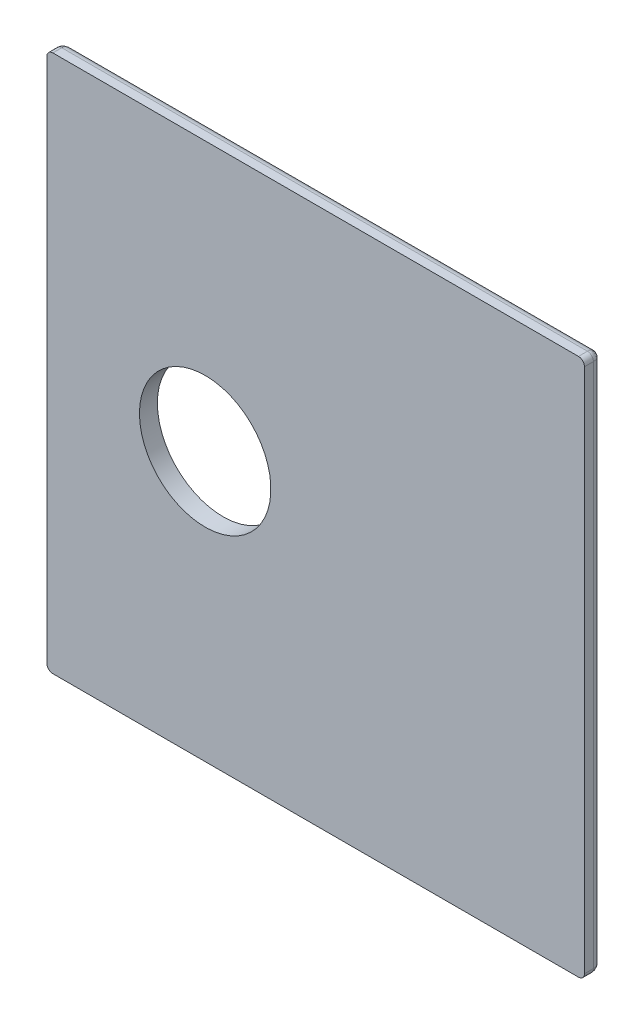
ISO-10303-21;
HEADER;
FILE_DESCRIPTION(('STEP AP214'),'2;1');
FILE_NAME('part.step','',(''),(''),'','','');
FILE_SCHEMA(('AUTOMOTIVE_DESIGN { 1 0 10303 214 1 1 1 1 }'));
ENDSEC;
DATA;
#1=APPLICATION_CONTEXT('core data for automotive mechanical design processes');
#2=APPLICATION_PROTOCOL_DEFINITION('international standard','automotive_design',2000,#1);
#3=PRODUCT_CONTEXT('',#1,'mechanical');
#4=PRODUCT('Part','Part','',(#3));
#5=PRODUCT_RELATED_PRODUCT_CATEGORY('part','',(#4));
#6=PRODUCT_DEFINITION_FORMATION('','',#4);
#7=PRODUCT_DEFINITION_CONTEXT('part definition',#1,'design');
#8=PRODUCT_DEFINITION('design','',#6,#7);
#9=PRODUCT_DEFINITION_SHAPE('','',#8);
#10=(LENGTH_UNIT() NAMED_UNIT(*) SI_UNIT(.MILLI.,.METRE.));
#11=(NAMED_UNIT(*) PLANE_ANGLE_UNIT() SI_UNIT($,.RADIAN.));
#12=(NAMED_UNIT(*) SI_UNIT($,.STERADIAN.) SOLID_ANGLE_UNIT());
#13=UNCERTAINTY_MEASURE_WITH_UNIT(LENGTH_MEASURE(1.E-05),#10,'distance_accuracy_value','');
#14=(GEOMETRIC_REPRESENTATION_CONTEXT(3) GLOBAL_UNCERTAINTY_ASSIGNED_CONTEXT((#13)) GLOBAL_UNIT_ASSIGNED_CONTEXT((#10,
#11,#12)) REPRESENTATION_CONTEXT('',''));
#15=CARTESIAN_POINT('',(0.,0.,0.));
#16=DIRECTION('',(0.,0.,1.));
#17=DIRECTION('',(1.,0.,0.));
#18=AXIS2_PLACEMENT_3D('',#15,#16,#17);
#19=CARTESIAN_POINT('',(44.,-45.,1.5));
#20=CARTESIAN_POINT('',(44.1495996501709,-45.,1.5));
#21=CARTESIAN_POINT('',(44.3738179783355,-44.9486369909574,1.5));
#22=CARTESIAN_POINT('',(44.6286992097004,-44.7883198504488,1.5));
#23=CARTESIAN_POINT('',(44.815061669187,-44.6021470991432,1.5));
#24=CARTESIAN_POINT('',(44.9618744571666,-44.3365612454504,1.5));
#25=CARTESIAN_POINT('',(45.,-44.1121997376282,1.5));
#26=CARTESIAN_POINT('',(45.,-44.,1.5));
#27=CARTESIAN_POINT('',(44.,-45.,1.38780026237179));
#28=CARTESIAN_POINT('',(44.1495996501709,-45.,1.3765841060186));
#29=CARTESIAN_POINT('',(44.3738179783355,-44.9486369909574,1.36367785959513));
#30=CARTESIAN_POINT('',(44.6286992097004,-44.7883198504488,1.35659921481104));
#31=CARTESIAN_POINT('',(44.815061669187,-44.6021470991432,1.3565890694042));
#32=CARTESIAN_POINT('',(44.9618744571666,-44.3365612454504,1.36547389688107));
#33=CARTESIAN_POINT('',(45.,-44.1121997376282,1.37940644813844));
#34=CARTESIAN_POINT('',(45.,-44.,1.38780026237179));
#35=CARTESIAN_POINT('',(43.9915290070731,-44.9745870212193,1.16354424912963));
#36=CARTESIAN_POINT('',(44.1352791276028,-44.9694358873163,1.13007528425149));
#37=CARTESIAN_POINT('',(44.3507424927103,-44.9134457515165,1.09154209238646));
#38=CARTESIAN_POINT('',(44.5975953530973,-44.7537321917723,1.07040899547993));
#39=CARTESIAN_POINT('',(44.7798730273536,-44.5716177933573,1.07037784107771));
#40=CARTESIAN_POINT('',(44.9271429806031,-44.3149302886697,1.09690476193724));
#41=CARTESIAN_POINT('',(44.9707116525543,-44.0993392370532,1.13849398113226));
#42=CARTESIAN_POINT('',(44.9745870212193,-43.9915290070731,1.16354424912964));
#43=CARTESIAN_POINT('',(43.9419195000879,-44.8257585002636,0.736975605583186));
#44=CARTESIAN_POINT('',(44.0557427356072,-44.7962162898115,0.680637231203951));
#45=CARTESIAN_POINT('',(44.2264648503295,-44.7204085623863,0.617015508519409));
#46=CARTESIAN_POINT('',(44.4308947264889,-44.5673073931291,0.582383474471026));
#47=CARTESIAN_POINT('',(44.5901157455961,-44.4081734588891,0.582345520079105));
#48=CARTESIAN_POINT('',(44.7358556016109,-44.1980442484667,0.625770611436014));
#49=CARTESIAN_POINT('',(44.8036739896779,-44.0273088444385,0.694786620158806));
#50=CARTESIAN_POINT('',(44.8257585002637,-43.9419195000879,0.736975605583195));
#51=CARTESIAN_POINT('',(43.8462795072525,-44.5388385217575,0.377495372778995));
#52=CARTESIAN_POINT('',(43.9223655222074,-44.4924880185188,0.337547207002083));
#53=CARTESIAN_POINT('',(44.036523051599,-44.4109760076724,0.293818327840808));
#54=CARTESIAN_POINT('',(44.1810914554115,-44.2838412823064,0.270305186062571));
#55=CARTESIAN_POINT('',(44.3009930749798,-44.1639660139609,0.270293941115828));
#56=CARTESIAN_POINT('',(44.4256165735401,-44.0174986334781,0.299724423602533));
#57=CARTESIAN_POINT('',(44.504138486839,-43.9033613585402,0.347551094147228));
#58=CARTESIAN_POINT('',(44.5388385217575,-43.8462795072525,0.377495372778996));
#59=CARTESIAN_POINT('',(43.6868592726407,-44.0605778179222,0.077186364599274));
#60=CARTESIAN_POINT('',(43.7226866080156,-44.0254468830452,0.066456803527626));
#61=CARTESIAN_POINT('',(43.7764620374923,-43.9725851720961,0.055005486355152));
#62=CARTESIAN_POINT('',(43.8479796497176,-43.9014686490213,0.048911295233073));
#63=CARTESIAN_POINT('',(43.9104029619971,-43.8390620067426,0.048911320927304));
#64=CARTESIAN_POINT('',(43.9814436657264,-43.7674966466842,0.056527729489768));
#65=CARTESIAN_POINT('',(44.034292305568,-43.7137463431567,0.069135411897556));
#66=CARTESIAN_POINT('',(44.0605778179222,-43.6868592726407,0.077186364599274));
#67=CARTESIAN_POINT('',(43.5747998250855,-43.7243994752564,0.));
#68=CARTESIAN_POINT('',(43.589047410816,-43.7101518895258,0.));
#69=CARTESIAN_POINT('',(43.6104187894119,-43.68878051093,0.));
#70=CARTESIAN_POINT('',(43.638913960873,-43.6602853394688,0.));
#71=CARTESIAN_POINT('',(43.6638472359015,-43.6353520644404,0.));
#72=CARTESIAN_POINT('',(43.6923424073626,-43.6068568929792,0.));
#73=CARTESIAN_POINT('',(43.7137137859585,-43.5854855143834,0.));
#74=CARTESIAN_POINT('',(43.7243994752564,-43.5747998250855,0.));
#75=CARTESIAN_POINT('',(43.5,-43.5,0.));
#76=CARTESIAN_POINT('',(43.5,-43.5,0.));
#77=CARTESIAN_POINT('',(43.5,-43.5,0.));
#78=CARTESIAN_POINT('',(43.5,-43.5,0.));
#79=CARTESIAN_POINT('',(43.5,-43.5,0.));
#80=CARTESIAN_POINT('',(43.5,-43.5,0.));
#81=CARTESIAN_POINT('',(43.5,-43.5,0.));
#82=CARTESIAN_POINT('',(43.5,-43.5,0.));
#83=B_SPLINE_SURFACE_WITH_KNOTS('',3,3,((#19,#20,#21,#22,#23,#24,#25,#26),(#27,#28,#29,#30,#31,
#32,#33,#34),(#35,#36,#37,#38,#39,#40,#41,#42),(#43,#44,#45,#46,#47,#48,#49,#50),(#51,#52,#53,
#54,#55,#56,#57,#58),(#59,#60,#61,#62,#63,#64,#65,#66),(#67,#68,#69,#70,#71,#72,#73,#74),(#75,
#76,#77,#78,#79,#80,#81,#82)),.UNSPECIFIED.,.F.,.F.,.F.,(4,1,1,1,1,4),(4,1,1,1,1,4),(0.,
0.224399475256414,0.448798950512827,0.897597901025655,1.12199737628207,1.5707963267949),(0.,
0.285714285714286,0.428571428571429,0.571428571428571,0.785714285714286,1.),.UNSPECIFIED.);
#84=CARTESIAN_POINT('',(43.5,-43.5,0.));
#85=CARTESIAN_POINT('',(43.7243994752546,-43.5747998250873,0.));
#86=CARTESIAN_POINT('',(44.0605778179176,-43.6868592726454,0.0771863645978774));
#87=CARTESIAN_POINT('',(44.5388385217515,-43.8462795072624,0.377495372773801));
#88=CARTESIAN_POINT('',(44.8257585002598,-43.9419195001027,0.736975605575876));
#89=CARTESIAN_POINT('',(44.9745870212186,-43.9915290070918,1.16354424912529));
#90=CARTESIAN_POINT('',(45.,-44.0000000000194,1.38780026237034));
#91=CARTESIAN_POINT('',(45.,-44.0000000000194,1.5));
#92=B_SPLINE_CURVE_WITH_KNOTS('',3,(#84,#85,#86,#87,#88,#89,#90,#91),.UNSPECIFIED.,.F.,.F.,(4,1,
1,1,1,4),(0.,0.448798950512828,0.673198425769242,1.12199737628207,1.34639685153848,
1.5707963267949),.UNSPECIFIED.);
#93=CARTESIAN_POINT('',(45.,-44.0000000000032,1.5));
#94=VERTEX_POINT('',#93);
#95=CARTESIAN_POINT('',(43.5,-43.5,0.));
#96=VERTEX_POINT('',#95);
#97=EDGE_CURVE('E114',#94,#96,#92,.F.);
#98=CARTESIAN_POINT('',(45.,-44.,1.5));
#99=CARTESIAN_POINT('',(45.,-44.1121997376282,1.5));
#100=CARTESIAN_POINT('',(44.9618744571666,-44.3365612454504,1.5));
#101=CARTESIAN_POINT('',(44.815061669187,-44.6021470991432,1.5));
#102=CARTESIAN_POINT('',(44.6286992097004,-44.7883198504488,1.5));
#103=CARTESIAN_POINT('',(44.3738179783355,-44.9486369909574,1.5));
#104=CARTESIAN_POINT('',(44.1495996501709,-45.,1.5));
#105=CARTESIAN_POINT('',(44.,-45.,1.5));
#106=B_SPLINE_CURVE_WITH_KNOTS('',3,(#98,#99,#100,#101,#102,#103,#104,#105),.UNSPECIFIED.,.F.,
.F.,(4,1,1,1,1,4),(0.,0.214285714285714,0.428571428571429,0.571428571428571,0.714285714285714,
1.),.UNSPECIFIED.);
#107=CARTESIAN_POINT('',(44.,-45.,1.5));
#108=VERTEX_POINT('',#107);
#109=EDGE_CURVE('E97',#94,#108,#106,.T.);
#110=CARTESIAN_POINT('',(44.,-45.,1.5));
#111=CARTESIAN_POINT('',(44.,-45.,1.38780026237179));
#112=CARTESIAN_POINT('',(43.9915290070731,-44.9745870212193,1.16354424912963));
#113=CARTESIAN_POINT('',(43.9419195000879,-44.8257585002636,0.736975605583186));
#114=CARTESIAN_POINT('',(43.8462795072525,-44.5388385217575,0.377495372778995));
#115=CARTESIAN_POINT('',(43.6868592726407,-44.0605778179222,0.077186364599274));
#116=CARTESIAN_POINT('',(43.5747998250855,-43.7243994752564,0.));
#117=CARTESIAN_POINT('',(43.5,-43.5,0.));
#118=B_SPLINE_CURVE_WITH_KNOTS('',3,(#110,#111,#112,#113,#114,#115,#116,#117),.UNSPECIFIED.,.F.,
.F.,(4,1,1,1,1,4),(0.,0.224399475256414,0.448798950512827,0.897597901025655,1.12199737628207,
1.5707963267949),.UNSPECIFIED.);
#119=EDGE_CURVE('E118',#96,#108,#118,.F.);
#120=ORIENTED_EDGE('',*,*,#97,.F.);
#121=ORIENTED_EDGE('',*,*,#109,.T.);
#122=ORIENTED_EDGE('',*,*,#119,.F.);
#123=EDGE_LOOP('',(#120,#121,#122));
#124=FACE_BOUND('',#123,.T.);
#125=ADVANCED_FACE('F16',(#124),#83,.T.);
#126=CARTESIAN_POINT('',(45.,44.,1.5));
#127=CARTESIAN_POINT('',(45.,44.1495996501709,1.5));
#128=CARTESIAN_POINT('',(44.9486369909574,44.3738179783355,1.5));
#129=CARTESIAN_POINT('',(44.7883198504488,44.6286992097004,1.5));
#130=CARTESIAN_POINT('',(44.6021470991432,44.8150616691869,1.5));
#131=CARTESIAN_POINT('',(44.3365612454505,44.9618744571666,1.5));
#132=CARTESIAN_POINT('',(44.1121997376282,45.,1.5));
#133=CARTESIAN_POINT('',(44.,45.,1.5));
#134=CARTESIAN_POINT('',(45.,44.,1.38780026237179));
#135=CARTESIAN_POINT('',(45.,44.1495996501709,1.3765841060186));
#136=CARTESIAN_POINT('',(44.9486369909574,44.3738179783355,1.36367785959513));
#137=CARTESIAN_POINT('',(44.7883198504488,44.6286992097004,1.35659921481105));
#138=CARTESIAN_POINT('',(44.6021470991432,44.8150616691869,1.3565890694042));
#139=CARTESIAN_POINT('',(44.3365612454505,44.9618744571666,1.36547389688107));
#140=CARTESIAN_POINT('',(44.1121997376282,45.,1.37940644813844));
#141=CARTESIAN_POINT('',(44.,45.,1.38780026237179));
#142=CARTESIAN_POINT('',(44.9745870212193,43.9915290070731,1.16354424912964));
#143=CARTESIAN_POINT('',(44.9694358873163,44.1352791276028,1.1300752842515));
#144=CARTESIAN_POINT('',(44.9134457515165,44.3507424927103,1.09154209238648));
#145=CARTESIAN_POINT('',(44.7537321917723,44.5975953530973,1.07040899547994));
#146=CARTESIAN_POINT('',(44.5716177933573,44.7798730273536,1.07037784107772));
#147=CARTESIAN_POINT('',(44.3149302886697,44.9271429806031,1.09690476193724));
#148=CARTESIAN_POINT('',(44.0993392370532,44.9707116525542,1.13849398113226));
#149=CARTESIAN_POINT('',(43.9915290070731,44.9745870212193,1.16354424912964));
#150=CARTESIAN_POINT('',(44.8257585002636,43.9419195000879,0.736975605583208));
#151=CARTESIAN_POINT('',(44.7962162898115,44.0557427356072,0.680637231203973));
#152=CARTESIAN_POINT('',(44.7204085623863,44.2264648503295,0.617015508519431));
#153=CARTESIAN_POINT('',(44.5673073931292,44.4308947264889,0.582383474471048));
#154=CARTESIAN_POINT('',(44.4081734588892,44.5901157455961,0.582345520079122));
#155=CARTESIAN_POINT('',(44.1980442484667,44.7358556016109,0.625770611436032));
#156=CARTESIAN_POINT('',(44.0273088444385,44.8036739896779,0.694786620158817));
#157=CARTESIAN_POINT('',(43.9419195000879,44.8257585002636,0.736975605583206));
#158=CARTESIAN_POINT('',(44.5388385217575,43.8462795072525,0.377495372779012));
#159=CARTESIAN_POINT('',(44.4924880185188,43.9223655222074,0.337547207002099));
#160=CARTESIAN_POINT('',(44.4109760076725,44.036523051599,0.293818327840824));
#161=CARTESIAN_POINT('',(44.2838412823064,44.1810914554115,0.270305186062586));
#162=CARTESIAN_POINT('',(44.163966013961,44.3009930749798,0.270293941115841));
#163=CARTESIAN_POINT('',(44.0174986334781,44.4256165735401,0.299724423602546));
#164=CARTESIAN_POINT('',(43.9033613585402,44.504138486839,0.347551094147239));
#165=CARTESIAN_POINT('',(43.8462795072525,44.5388385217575,0.377495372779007));
#166=CARTESIAN_POINT('',(44.0605778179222,43.6868592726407,0.077186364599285));
#167=CARTESIAN_POINT('',(44.0254468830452,43.7226866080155,0.066456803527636));
#168=CARTESIAN_POINT('',(43.9725851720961,43.7764620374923,0.055005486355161));
#169=CARTESIAN_POINT('',(43.9014686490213,43.8479796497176,0.048911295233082));
#170=CARTESIAN_POINT('',(43.8390620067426,43.9104029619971,0.048911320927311));
#171=CARTESIAN_POINT('',(43.7674966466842,43.9814436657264,0.056527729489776));
#172=CARTESIAN_POINT('',(43.7137463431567,44.034292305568,0.069135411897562));
#173=CARTESIAN_POINT('',(43.6868592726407,44.0605778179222,0.077186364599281));
#174=CARTESIAN_POINT('',(43.7243994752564,43.5747998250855,0.));
#175=CARTESIAN_POINT('',(43.7101518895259,43.589047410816,0.));
#176=CARTESIAN_POINT('',(43.68878051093,43.6104187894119,0.));
#177=CARTESIAN_POINT('',(43.6602853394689,43.638913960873,0.));
#178=CARTESIAN_POINT('',(43.6353520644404,43.6638472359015,0.));
#179=CARTESIAN_POINT('',(43.6068568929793,43.6923424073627,0.));
#180=CARTESIAN_POINT('',(43.5854855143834,43.7137137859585,0.));
#181=CARTESIAN_POINT('',(43.5747998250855,43.7243994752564,0.));
#182=CARTESIAN_POINT('',(43.5,43.5,0.));
#183=CARTESIAN_POINT('',(43.5,43.5,0.));
#184=CARTESIAN_POINT('',(43.5,43.5,0.));
#185=CARTESIAN_POINT('',(43.5,43.5,0.));
#186=CARTESIAN_POINT('',(43.5,43.5,0.));
#187=CARTESIAN_POINT('',(43.5,43.5,0.));
#188=CARTESIAN_POINT('',(43.5,43.5,0.));
#189=CARTESIAN_POINT('',(43.5,43.5,0.));
#190=B_SPLINE_SURFACE_WITH_KNOTS('',3,3,((#126,#127,#128,#129,#130,#131,#132,#133),(#134,#135,
#136,#137,#138,#139,#140,#141),(#142,#143,#144,#145,#146,#147,#148,#149),(#150,#151,#152,#153,
#154,#155,#156,#157),(#158,#159,#160,#161,#162,#163,#164,#165),(#166,#167,#168,#169,#170,#171,
#172,#173),(#174,#175,#176,#177,#178,#179,#180,#181),(#182,#183,#184,#185,#186,#187,#188,#189)),
.UNSPECIFIED.,.F.,.F.,.F.,(4,1,1,1,1,4),(4,1,1,1,1,4),(0.,0.224399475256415,0.448798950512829,
0.897597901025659,1.12199737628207,1.5707963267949),(0.,0.285714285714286,0.428571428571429,
0.571428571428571,0.785714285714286,1.),.UNSPECIFIED.);
#191=CARTESIAN_POINT('',(43.5,43.5,0.));
#192=CARTESIAN_POINT('',(43.574799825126,43.7243994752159,0.));
#193=CARTESIAN_POINT('',(43.6868592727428,44.0605778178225,0.0771863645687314));
#194=CARTESIAN_POINT('',(43.8462795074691,44.5388385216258,0.377495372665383));
#195=CARTESIAN_POINT('',(43.9419195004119,44.8257585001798,0.736975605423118));
#196=CARTESIAN_POINT('',(43.9915290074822,44.9745870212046,1.16354424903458));
#197=CARTESIAN_POINT('',(44.0000000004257,45.,1.38780026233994));
#198=CARTESIAN_POINT('',(44.0000000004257,45.,1.5));
#199=B_SPLINE_CURVE_WITH_KNOTS('',3,(#191,#192,#193,#194,#195,#196,#197,#198),.UNSPECIFIED.,.F.,
.F.,(4,1,1,1,1,4),(0.,0.448798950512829,0.673198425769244,1.12199737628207,1.34639685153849,
1.5707963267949),.UNSPECIFIED.);
#200=CARTESIAN_POINT('',(44.0000000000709,45.,1.5));
#201=VERTEX_POINT('',#200);
#202=CARTESIAN_POINT('',(43.5,43.5,0.));
#203=VERTEX_POINT('',#202);
#204=EDGE_CURVE('E226',#201,#203,#199,.F.);
#205=CARTESIAN_POINT('',(44.,45.,1.5));
#206=CARTESIAN_POINT('',(44.0130898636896,45.0000000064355,1.5));
#207=CARTESIAN_POINT('',(44.0261796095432,44.99974053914,1.5));
#208=CARTESIAN_POINT('',(44.0523386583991,44.9987060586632,1.5));
#209=CARTESIAN_POINT('',(44.0654079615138,44.9979310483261,1.5));
#210=CARTESIAN_POINT('',(44.0915061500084,44.9958688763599,1.5));
#211=CARTESIAN_POINT('',(44.1045350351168,44.9945817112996,1.5));
#212=CARTESIAN_POINT('',(44.1305324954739,44.9914986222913,1.5));
#213=CARTESIAN_POINT('',(44.1435010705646,44.9897026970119,1.5));
#214=CARTESIAN_POINT('',(44.1693579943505,44.9856054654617,1.5));
#215=CARTESIAN_POINT('',(44.1822463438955,44.9833041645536,1.5));
#216=CARTESIAN_POINT('',(44.2079229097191,44.9781995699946,1.5));
#217=CARTESIAN_POINT('',(44.2207111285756,44.9753962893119,1.5));
#218=CARTESIAN_POINT('',(44.2461675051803,44.9692910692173,1.5));
#219=CARTESIAN_POINT('',(44.2588356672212,44.9659891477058,1.5));
#220=CARTESIAN_POINT('',(44.2840320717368,44.9588901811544,1.5));
#221=CARTESIAN_POINT('',(44.2965603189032,44.9550931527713,1.5));
#222=CARTESIAN_POINT('',(44.3214567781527,44.9470067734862,1.5));
#223=CARTESIAN_POINT('',(44.3338249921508,44.9427174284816,1.5));
#224=CARTESIAN_POINT('',(44.3583822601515,44.933652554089,1.5));
#225=CARTESIAN_POINT('',(44.3705713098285,44.9288770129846,1.5));
#226=CARTESIAN_POINT('',(44.394752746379,44.9188503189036,1.5));
#227=CARTESIAN_POINT('',(44.4067451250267,44.913599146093,1.5));
#228=CARTESIAN_POINT('',(44.4305154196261,44.9026308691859,1.5));
#229=CARTESIAN_POINT('',(44.4422933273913,44.8969137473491,1.5));
#230=CARTESIAN_POINT('',(44.4656169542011,44.8850234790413,1.5));
#231=CARTESIAN_POINT('',(44.4771626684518,44.8788503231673,1.5));
#232=CARTESIAN_POINT('',(44.500004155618,44.8660578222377,1.5));
#233=CARTESIAN_POINT('',(44.5112999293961,44.8594384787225,1.5));
#234=CARTESIAN_POINT('',(44.5336237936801,44.8457634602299,1.5));
#235=CARTESIAN_POINT('',(44.5446518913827,44.8387077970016,1.5));
#236=CARTESIAN_POINT('',(44.56642263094,44.8241699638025,1.5));
#237=CARTESIAN_POINT('',(44.5771652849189,44.8166878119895,1.5));
#238=CARTESIAN_POINT('',(44.5983474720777,44.8013069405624,1.5));
#239=CARTESIAN_POINT('',(44.6087870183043,44.7934082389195,1.5));
#240=CARTESIAN_POINT('',(44.6293449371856,44.777203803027,1.5));
#241=CARTESIAN_POINT('',(44.639463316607,44.7688980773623,1.5));
#242=CARTESIAN_POINT('',(44.6593647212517,44.7518939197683,1.5));
#243=CARTESIAN_POINT('',(44.669147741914,44.7431954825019,1.5));
#244=CARTESIAN_POINT('',(44.6883649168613,44.7254208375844,1.5));
#245=CARTESIAN_POINT('',(44.6977990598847,44.7163446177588,1.5));
#246=CARTESIAN_POINT('',(44.7163047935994,44.6978291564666,1.5));
#247=CARTESIAN_POINT('',(44.7253763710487,44.6883899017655,1.5));
#248=CARTESIAN_POINT('',(44.7431433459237,44.6691631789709,1.5));
#249=CARTESIAN_POINT('',(44.7518387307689,44.6593756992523,1.5));
#250=CARTESIAN_POINT('',(44.7688396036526,44.63946725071,1.5));
#251=CARTESIAN_POINT('',(44.7771450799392,44.6293462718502,1.5));
#252=CARTESIAN_POINT('',(44.7933526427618,44.6087858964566,1.5));
#253=CARTESIAN_POINT('',(44.8012547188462,44.5983464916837,1.5));
#254=CARTESIAN_POINT('',(44.8166438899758,44.5771661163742,1.5));
#255=CARTESIAN_POINT('',(44.8241309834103,44.5664251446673,1.5));
#256=CARTESIAN_POINT('',(44.8386784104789,44.5446583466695,1.5));
#257=CARTESIAN_POINT('',(44.8457387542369,44.5336325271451,1.5));
#258=CARTESIAN_POINT('',(44.8594208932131,44.5113127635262,1.5));
#259=CARTESIAN_POINT('',(44.8660427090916,44.5000188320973,1.5));
#260=CARTESIAN_POINT('',(44.8788361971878,44.4771796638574,1.5));
#261=CARTESIAN_POINT('',(44.8850078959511,44.4656344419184,1.5));
#262=CARTESIAN_POINT('',(44.8968888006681,44.4423091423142,1.5));
#263=CARTESIAN_POINT('',(44.9025980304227,44.4305290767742,1.5));
#264=CARTESIAN_POINT('',(44.9135450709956,44.4067521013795,1.5));
#265=CARTESIAN_POINT('',(44.9187828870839,44.3947551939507,1.5));
#266=CARTESIAN_POINT('',(44.9287829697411,44.3705644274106,1.5));
#267=CARTESIAN_POINT('',(44.933545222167,44.3583705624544,1.5));
#268=CARTESIAN_POINT('',(44.9425891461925,44.3338053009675,1.5));
#269=CARTESIAN_POINT('',(44.9468707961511,44.3214338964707,1.5));
#270=CARTESIAN_POINT('',(44.954948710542,44.2965330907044,1.5));
#271=CARTESIAN_POINT('',(44.9587449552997,44.2840036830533,1.5));
#272=CARTESIAN_POINT('',(44.9658471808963,44.2588063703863,1.5));
#273=CARTESIAN_POINT('',(44.9691531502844,44.2461384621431,1.5));
#274=CARTESIAN_POINT('',(44.9752699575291,44.2206836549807,1.5));
#275=CARTESIAN_POINT('',(44.9780807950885,44.2078967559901,1.5));
#276=CARTESIAN_POINT('',(44.9832024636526,44.1822234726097,1.5));
#277=CARTESIAN_POINT('',(44.985513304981,44.1693370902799,1.5));
#278=CARTESIAN_POINT('',(44.9896301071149,44.1434843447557,1.5));
#279=CARTESIAN_POINT('',(44.9914360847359,44.13051798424,1.5));
#280=CARTESIAN_POINT('',(44.9945382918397,44.1045247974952,1.5));
#281=CARTESIAN_POINT('',(44.9958345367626,44.0914979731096,1.5));
#282=CARTESIAN_POINT('',(44.9979124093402,44.0654033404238,1.5));
#283=CARTESIAN_POINT('',(44.9986940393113,44.0523355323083,1.5));
#284=CARTESIAN_POINT('',(44.9997378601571,44.0261785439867,1.5));
#285=CARTESIAN_POINT('',(45.0000000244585,44.0130893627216,1.5));
#286=CARTESIAN_POINT('',(45.,44.,1.5));
#287=B_SPLINE_CURVE_WITH_KNOTS('',3,(#205,#206,#207,#208,#209,#210,#211,#212,#213,#214,#215,
#216,#217,#218,#219,#220,#221,#222,#223,#224,#225,#226,#227,#228,#229,#230,#231,#232,#233,#234,
#235,#236,#237,#238,#239,#240,#241,#242,#243,#244,#245,#246,#247,#248,#249,#250,#251,#252,#253,
#254,#255,#256,#257,#258,#259,#260,#261,#262,#263,#264,#265,#266,#267,#268,#269,#270,#271,#272,
#273,#274,#275,#276,#277,#278,#279,#280,#281,#282,#283,#284,#285,#286),.UNSPECIFIED.,.F.,.F.,(4,
2,2,2,2,2,2,2,2,2,2,2,2,2,2,2,2,2,2,2,2,2,2,2,2,2,2,2,2,2,2,2,2,2,2,2,2,2,2,2,4),(0.,
0.0392668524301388,0.0785334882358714,0.117800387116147,0.157067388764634,0.196333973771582,
0.235599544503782,0.274863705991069,0.314126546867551,0.353388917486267,0.392652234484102,
0.431917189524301,0.471183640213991,0.510450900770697,0.549718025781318,0.588984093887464,
0.628248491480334,0.667511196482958,0.706773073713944,0.746035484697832,0.785299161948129,
0.824564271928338,0.863830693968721,0.903098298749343,0.942366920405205,0.98163569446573,
1.02090353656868,1.06016952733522,1.09943320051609,1.13869485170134,1.17795606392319,
1.21721844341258,1.25648259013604,1.29574832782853,1.33501498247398,1.37428166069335,
1.4135475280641,1.45281208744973,1.49207545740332,1.53133865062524,1.57060385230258),.UNSPECIFIED.);
#288=CARTESIAN_POINT('',(45.,44.,1.5));
#289=VERTEX_POINT('',#288);
#290=EDGE_CURVE('E110',#201,#289,#287,.T.);
#291=CARTESIAN_POINT('',(45.,44.,1.5));
#292=CARTESIAN_POINT('',(45.,44.,1.38780026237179));
#293=CARTESIAN_POINT('',(44.9745870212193,43.9915290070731,1.16354424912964));
#294=CARTESIAN_POINT('',(44.8257585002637,43.9419195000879,0.736975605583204));
#295=CARTESIAN_POINT('',(44.5388385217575,43.8462795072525,0.377495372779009));
#296=CARTESIAN_POINT('',(44.0605778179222,43.6868592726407,0.0771863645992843));
#297=CARTESIAN_POINT('',(43.7243994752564,43.5747998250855,0.));
#298=CARTESIAN_POINT('',(43.5,43.5,0.));
#299=B_SPLINE_CURVE_WITH_KNOTS('',3,(#291,#292,#293,#294,#295,#296,#297,#298),.UNSPECIFIED.,.F.,
.F.,(4,1,1,1,1,4),(0.,0.224399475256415,0.448798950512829,0.897597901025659,1.12199737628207,
1.5707963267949),.UNSPECIFIED.);
#300=EDGE_CURVE('E126',#203,#289,#299,.F.);
#301=ORIENTED_EDGE('',*,*,#204,.F.);
#302=ORIENTED_EDGE('',*,*,#290,.T.);
#303=ORIENTED_EDGE('',*,*,#300,.F.);
#304=EDGE_LOOP('',(#301,#302,#303));
#305=FACE_BOUND('',#304,.T.);
#306=ADVANCED_FACE('F331',(#305),#190,.T.);
#307=CARTESIAN_POINT('',(-44.,45.,1.5));
#308=CARTESIAN_POINT('',(-44.149599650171,45.,1.5));
#309=CARTESIAN_POINT('',(-44.3738179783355,44.9486369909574,1.5));
#310=CARTESIAN_POINT('',(-44.6286992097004,44.7883198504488,1.5));
#311=CARTESIAN_POINT('',(-44.815061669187,44.6021470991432,1.5));
#312=CARTESIAN_POINT('',(-44.9618744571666,44.3365612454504,1.5));
#313=CARTESIAN_POINT('',(-45.,44.1121997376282,1.5));
#314=CARTESIAN_POINT('',(-45.,44.,1.5));
#315=CARTESIAN_POINT('',(-44.,45.,1.38780026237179));
#316=CARTESIAN_POINT('',(-44.149599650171,45.,1.3765841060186));
#317=CARTESIAN_POINT('',(-44.3738179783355,44.9486369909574,1.36367785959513));
#318=CARTESIAN_POINT('',(-44.6286992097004,44.7883198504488,1.35659921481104));
#319=CARTESIAN_POINT('',(-44.815061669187,44.6021470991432,1.3565890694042));
#320=CARTESIAN_POINT('',(-44.9618744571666,44.3365612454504,1.36547389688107));
#321=CARTESIAN_POINT('',(-45.,44.1121997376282,1.37940644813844));
#322=CARTESIAN_POINT('',(-45.,44.,1.38780026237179));
#323=CARTESIAN_POINT('',(-43.99158744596,44.97476233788,1.16338475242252));
#324=CARTESIAN_POINT('',(-44.1351532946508,44.9692850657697,1.12989829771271));
#325=CARTESIAN_POINT('',(-44.3503398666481,44.9129472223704,1.0913999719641));
#326=CARTESIAN_POINT('',(-44.5969903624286,44.7530926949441,1.07029855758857));
#327=CARTESIAN_POINT('',(-44.7792263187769,44.571018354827,1.07026789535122));
#328=CARTESIAN_POINT('',(-44.9266870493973,44.3145733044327,1.09675315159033));
#329=CARTESIAN_POINT('',(-44.9706403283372,44.0992588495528,1.13831965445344));
#330=CARTESIAN_POINT('',(-44.97476233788,43.99158744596,1.16338475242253));
#331=CARTESIAN_POINT('',(-43.9542724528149,44.8628173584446,0.843754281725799));
#332=CARTESIAN_POINT('',(-44.0757412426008,44.8396581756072,0.79317059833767));
#333=CARTESIAN_POINT('',(-44.2578925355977,44.7691042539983,0.73581698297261));
#334=CARTESIAN_POINT('',(-44.4731048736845,44.6144778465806,0.704548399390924));
#335=CARTESIAN_POINT('',(-44.6381244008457,44.4495649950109,0.704511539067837));
#336=CARTESIAN_POINT('',(-44.7840758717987,44.2275840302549,0.743728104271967));
#337=CARTESIAN_POINT('',(-44.8454972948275,44.0453894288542,0.805878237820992));
#338=CARTESIAN_POINT('',(-44.8628173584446,43.9542724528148,0.843754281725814));
#339=CARTESIAN_POINT('',(-43.8742565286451,44.6227695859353,0.461142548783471));
#340=CARTESIAN_POINT('',(-43.9596864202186,44.578664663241,0.41371384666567));
#341=CARTESIAN_POINT('',(-44.0878690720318,44.4960491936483,0.361350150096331));
#342=CARTESIAN_POINT('',(-44.2480507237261,44.360236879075,0.333100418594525));
#343=CARTESIAN_POINT('',(-44.3789740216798,44.2293531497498,0.333081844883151));
#344=CARTESIAN_POINT('',(-44.51127532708,44.0665092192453,0.36845890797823));
#345=CARTESIAN_POINT('',(-44.5897773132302,43.9383532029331,0.425599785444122));
#346=CARTESIAN_POINT('',(-44.6227695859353,43.8742565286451,0.461142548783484));
#347=CARTESIAN_POINT('',(-43.724383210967,44.173149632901,0.102460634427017));
#348=CARTESIAN_POINT('',(-43.7669260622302,44.1301594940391,0.088220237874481));
#349=CARTESIAN_POINT('',(-43.8307795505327,44.0658620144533,0.073204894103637));
#350=CARTESIAN_POINT('',(-43.9160957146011,43.9801877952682,0.065253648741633));
#351=CARTESIAN_POINT('',(-43.9908895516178,43.9054100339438,0.065255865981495));
#352=CARTESIAN_POINT('',(-44.0765951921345,43.8201331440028,0.075185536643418));
#353=CARTESIAN_POINT('',(-44.1409764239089,43.7563084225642,0.091772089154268));
#354=CARTESIAN_POINT('',(-44.1731496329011,43.724383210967,0.102460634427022));
#355=CARTESIAN_POINT('',(-43.5747998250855,43.7243994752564,0.));
#356=CARTESIAN_POINT('',(-43.5890474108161,43.7101518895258,0.));
#357=CARTESIAN_POINT('',(-43.6104187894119,43.6887805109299,0.));
#358=CARTESIAN_POINT('',(-43.638913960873,43.6602853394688,0.));
#359=CARTESIAN_POINT('',(-43.6638472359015,43.6353520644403,0.));
#360=CARTESIAN_POINT('',(-43.6923424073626,43.6068568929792,0.));
#361=CARTESIAN_POINT('',(-43.7137137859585,43.5854855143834,0.));
#362=CARTESIAN_POINT('',(-43.7243994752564,43.5747998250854,0.));
#363=CARTESIAN_POINT('',(-43.5,43.5,0.));
#364=CARTESIAN_POINT('',(-43.5,43.5,0.));
#365=CARTESIAN_POINT('',(-43.5,43.4999999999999,0.));
#366=CARTESIAN_POINT('',(-43.5,43.5,0.));
#367=CARTESIAN_POINT('',(-43.5,43.4999999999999,0.));
#368=CARTESIAN_POINT('',(-43.5,43.5,0.));
#369=CARTESIAN_POINT('',(-43.5,43.5,0.));
#370=CARTESIAN_POINT('',(-43.5,43.5,0.));
#371=B_SPLINE_SURFACE_WITH_KNOTS('',3,3,((#307,#308,#309,#310,#311,#312,#313,#314),(#315,#316,
#317,#318,#319,#320,#321,#322),(#323,#324,#325,#326,#327,#328,#329,#330),(#331,#332,#333,#334,
#335,#336,#337,#338),(#339,#340,#341,#342,#343,#344,#345,#346),(#347,#348,#349,#350,#351,#352,
#353,#354),(#355,#356,#357,#358,#359,#360,#361,#362),(#363,#364,#365,#366,#367,#368,#369,#370)),
.UNSPECIFIED.,.F.,.F.,.F.,(4,1,1,1,1,4),(4,1,1,1,1,4),(0.,0.224399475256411,0.448798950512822,
0.673198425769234,1.12199737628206,1.57079632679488),(0.,0.285714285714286,0.428571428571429,
0.571428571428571,0.785714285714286,1.),.UNSPECIFIED.);
#372=CARTESIAN_POINT('',(-43.5,43.5,0.));
#373=CARTESIAN_POINT('',(-43.7243994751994,43.5747998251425,0.));
#374=CARTESIAN_POINT('',(-44.1731496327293,43.7243832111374,0.102460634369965));
#375=CARTESIAN_POINT('',(-44.6227695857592,43.8742565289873,0.461142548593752));
#376=CARTESIAN_POINT('',(-44.8628173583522,43.9542724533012,0.843754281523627));
#377=CARTESIAN_POINT('',(-44.974762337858,43.9915874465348,1.16338475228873));
#378=CARTESIAN_POINT('',(-45.,44.0000000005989,1.38780026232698));
#379=CARTESIAN_POINT('',(-45.,44.0000000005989,1.5));
#380=B_SPLINE_CURVE_WITH_KNOTS('',3,(#372,#373,#374,#375,#376,#377,#378,#379),.UNSPECIFIED.,.F.,
.F.,(4,1,1,1,1,4),(0.,0.448798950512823,0.897597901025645,1.12199737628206,1.34639685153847,
1.57079632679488),.UNSPECIFIED.);
#381=CARTESIAN_POINT('',(-45.,44.0000000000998,1.5));
#382=VERTEX_POINT('',#381);
#383=CARTESIAN_POINT('',(-43.5,43.5,0.));
#384=VERTEX_POINT('',#383);
#385=EDGE_CURVE('E174',#382,#384,#380,.F.);
#386=CARTESIAN_POINT('',(-45.,44.,1.5));
#387=CARTESIAN_POINT('',(-45.0000000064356,44.0130898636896,1.5));
#388=CARTESIAN_POINT('',(-44.99974053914,44.0261796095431,1.5));
#389=CARTESIAN_POINT('',(-44.9987060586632,44.052338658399,1.5));
#390=CARTESIAN_POINT('',(-44.9979310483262,44.0654079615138,1.5));
#391=CARTESIAN_POINT('',(-44.99586887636,44.0915061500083,1.5));
#392=CARTESIAN_POINT('',(-44.9945817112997,44.1045350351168,1.5));
#393=CARTESIAN_POINT('',(-44.9914986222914,44.1305324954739,1.5));
#394=CARTESIAN_POINT('',(-44.9897026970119,44.1435010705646,1.5));
#395=CARTESIAN_POINT('',(-44.9856054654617,44.1693579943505,1.5));
#396=CARTESIAN_POINT('',(-44.9833041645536,44.1822463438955,1.5));
#397=CARTESIAN_POINT('',(-44.9781995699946,44.2079229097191,1.5));
#398=CARTESIAN_POINT('',(-44.9753962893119,44.2207111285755,1.5));
#399=CARTESIAN_POINT('',(-44.9692910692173,44.2461675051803,1.5));
#400=CARTESIAN_POINT('',(-44.9659891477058,44.2588356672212,1.5));
#401=CARTESIAN_POINT('',(-44.9588901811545,44.2840320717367,1.5));
#402=CARTESIAN_POINT('',(-44.9550931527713,44.2965603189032,1.5));
#403=CARTESIAN_POINT('',(-44.9470067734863,44.3214567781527,1.5));
#404=CARTESIAN_POINT('',(-44.9427174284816,44.3338249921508,1.5));
#405=CARTESIAN_POINT('',(-44.9336525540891,44.3583822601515,1.5));
#406=CARTESIAN_POINT('',(-44.9288770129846,44.3705713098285,1.5));
#407=CARTESIAN_POINT('',(-44.9188503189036,44.394752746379,1.5));
#408=CARTESIAN_POINT('',(-44.913599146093,44.4067451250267,1.5));
#409=CARTESIAN_POINT('',(-44.9026308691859,44.4305154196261,1.5));
#410=CARTESIAN_POINT('',(-44.8969137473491,44.4422933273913,1.5));
#411=CARTESIAN_POINT('',(-44.8850234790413,44.4656169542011,1.5));
#412=CARTESIAN_POINT('',(-44.8788503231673,44.4771626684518,1.5));
#413=CARTESIAN_POINT('',(-44.8660578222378,44.5000041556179,1.5));
#414=CARTESIAN_POINT('',(-44.8594384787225,44.5112999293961,1.5));
#415=CARTESIAN_POINT('',(-44.8457634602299,44.5336237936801,1.5));
#416=CARTESIAN_POINT('',(-44.8387077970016,44.5446518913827,1.5));
#417=CARTESIAN_POINT('',(-44.8241699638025,44.56642263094,1.5));
#418=CARTESIAN_POINT('',(-44.8166878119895,44.5771652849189,1.5));
#419=CARTESIAN_POINT('',(-44.8013069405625,44.5983474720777,1.5));
#420=CARTESIAN_POINT('',(-44.7934082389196,44.6087870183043,1.5));
#421=CARTESIAN_POINT('',(-44.777203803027,44.6293449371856,1.5));
#422=CARTESIAN_POINT('',(-44.7688980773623,44.639463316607,1.5));
#423=CARTESIAN_POINT('',(-44.7518939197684,44.6593647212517,1.5));
#424=CARTESIAN_POINT('',(-44.7431954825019,44.669147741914,1.5));
#425=CARTESIAN_POINT('',(-44.7254208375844,44.6883649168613,1.5));
#426=CARTESIAN_POINT('',(-44.7163446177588,44.6977990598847,1.5));
#427=CARTESIAN_POINT('',(-44.6978291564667,44.7163047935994,1.5));
#428=CARTESIAN_POINT('',(-44.6883899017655,44.7253763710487,1.5));
#429=CARTESIAN_POINT('',(-44.6691631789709,44.7431433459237,1.5));
#430=CARTESIAN_POINT('',(-44.6593756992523,44.7518387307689,1.5));
#431=CARTESIAN_POINT('',(-44.6394672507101,44.7688396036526,1.5));
#432=CARTESIAN_POINT('',(-44.6293462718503,44.7771450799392,1.5));
#433=CARTESIAN_POINT('',(-44.6087858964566,44.7933526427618,1.5));
#434=CARTESIAN_POINT('',(-44.5983464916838,44.8012547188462,1.5));
#435=CARTESIAN_POINT('',(-44.5771661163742,44.8166438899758,1.5));
#436=CARTESIAN_POINT('',(-44.5664251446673,44.8241309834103,1.5));
#437=CARTESIAN_POINT('',(-44.5446583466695,44.8386784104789,1.5));
#438=CARTESIAN_POINT('',(-44.5336325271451,44.8457387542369,1.5));
#439=CARTESIAN_POINT('',(-44.5113127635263,44.8594208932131,1.5));
#440=CARTESIAN_POINT('',(-44.5000188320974,44.8660427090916,1.5));
#441=CARTESIAN_POINT('',(-44.4771796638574,44.8788361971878,1.5));
#442=CARTESIAN_POINT('',(-44.4656344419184,44.8850078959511,1.5));
#443=CARTESIAN_POINT('',(-44.4423091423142,44.8968888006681,1.5));
#444=CARTESIAN_POINT('',(-44.4305290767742,44.9025980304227,1.5));
#445=CARTESIAN_POINT('',(-44.4067521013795,44.9135450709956,1.5));
#446=CARTESIAN_POINT('',(-44.3947551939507,44.9187828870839,1.5));
#447=CARTESIAN_POINT('',(-44.3705644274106,44.9287829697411,1.5));
#448=CARTESIAN_POINT('',(-44.3583705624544,44.933545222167,1.5));
#449=CARTESIAN_POINT('',(-44.3338053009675,44.9425891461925,1.5));
#450=CARTESIAN_POINT('',(-44.3214338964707,44.9468707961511,1.5));
#451=CARTESIAN_POINT('',(-44.2965330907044,44.954948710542,1.5));
#452=CARTESIAN_POINT('',(-44.2840036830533,44.9587449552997,1.5));
#453=CARTESIAN_POINT('',(-44.2588063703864,44.9658471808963,1.5));
#454=CARTESIAN_POINT('',(-44.2461384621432,44.9691531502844,1.5));
#455=CARTESIAN_POINT('',(-44.2206836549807,44.9752699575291,1.5));
#456=CARTESIAN_POINT('',(-44.2078967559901,44.9780807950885,1.5));
#457=CARTESIAN_POINT('',(-44.1822234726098,44.9832024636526,1.5));
#458=CARTESIAN_POINT('',(-44.1693370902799,44.985513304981,1.5));
#459=CARTESIAN_POINT('',(-44.1434843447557,44.9896301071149,1.5));
#460=CARTESIAN_POINT('',(-44.13051798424,44.9914360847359,1.5));
#461=CARTESIAN_POINT('',(-44.1045247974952,44.9945382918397,1.5));
#462=CARTESIAN_POINT('',(-44.0914979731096,44.9958345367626,1.5));
#463=CARTESIAN_POINT('',(-44.0654033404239,44.9979124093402,1.5));
#464=CARTESIAN_POINT('',(-44.0523355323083,44.9986940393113,1.5));
#465=CARTESIAN_POINT('',(-44.0261785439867,44.9997378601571,1.5));
#466=CARTESIAN_POINT('',(-44.0130893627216,45.0000000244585,1.5));
#467=CARTESIAN_POINT('',(-44.,45.,1.5));
#468=B_SPLINE_CURVE_WITH_KNOTS('',3,(#386,#387,#388,#389,#390,#391,#392,#393,#394,#395,#396,
#397,#398,#399,#400,#401,#402,#403,#404,#405,#406,#407,#408,#409,#410,#411,#412,#413,#414,#415,
#416,#417,#418,#419,#420,#421,#422,#423,#424,#425,#426,#427,#428,#429,#430,#431,#432,#433,#434,
#435,#436,#437,#438,#439,#440,#441,#442,#443,#444,#445,#446,#447,#448,#449,#450,#451,#452,#453,
#454,#455,#456,#457,#458,#459,#460,#461,#462,#463,#464,#465,#466,#467),.UNSPECIFIED.,.F.,.F.,(4,
2,2,2,2,2,2,2,2,2,2,2,2,2,2,2,2,2,2,2,2,2,2,2,2,2,2,2,2,2,2,2,2,2,2,2,2,2,2,2,4),(0.,
0.0392668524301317,0.0785334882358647,0.11780038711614,0.157067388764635,0.196333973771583,
0.235599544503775,0.274863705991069,0.314126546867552,0.353388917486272,0.3926522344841,
0.431917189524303,0.471183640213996,0.51045090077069,0.549718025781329,0.588984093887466,
0.628248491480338,0.667511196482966,0.706773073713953,0.746035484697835,0.785299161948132,
0.824564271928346,0.86383069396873,0.903098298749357,0.942366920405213,0.981635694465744,
1.02090353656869,1.06016952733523,1.0994332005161,1.13869485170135,1.17795606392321,
1.21721844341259,1.25648259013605,1.29574832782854,1.335014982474,1.37428166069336,
1.41354752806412,1.45281208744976,1.49207545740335,1.53133865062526,1.5706038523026),.UNSPECIFIED.);
#469=CARTESIAN_POINT('',(-44.,45.,1.5));
#470=VERTEX_POINT('',#469);
#471=EDGE_CURVE('E358',#382,#470,#468,.T.);
#472=CARTESIAN_POINT('',(-44.,45.,1.5));
#473=CARTESIAN_POINT('',(-44.0000000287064,45.0000000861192,1.48036419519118));
#474=CARTESIAN_POINT('',(-43.9998711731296,44.9996135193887,1.46072850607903));
#475=CARTESIAN_POINT('',(-43.9993568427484,44.9980705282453,1.42148707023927));
#476=CARTESIAN_POINT('',(-43.9989713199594,44.9969139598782,1.40188132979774));
#477=CARTESIAN_POINT('',(-43.9979446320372,44.9938338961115,1.36273026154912));
#478=CARTESIAN_POINT('',(-43.9973033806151,44.9919101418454,1.34318495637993));
#479=CARTESIAN_POINT('',(-43.9957662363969,44.9872987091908,1.30418514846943));
#480=CARTESIAN_POINT('',(-43.9948702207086,44.9846106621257,1.28473069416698));
#481=CARTESIAN_POINT('',(-43.9928245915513,44.978473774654,1.24594295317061));
#482=CARTESIAN_POINT('',(-43.9916748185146,44.9750244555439,1.22660975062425));
#483=CARTESIAN_POINT('',(-43.9891225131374,44.9673675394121,1.18809500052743));
#484=CARTESIAN_POINT('',(-43.9877197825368,44.9631593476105,1.16891358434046));
#485=CARTESIAN_POINT('',(-43.9846632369,44.9539897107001,1.13073226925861));
#486=CARTESIAN_POINT('',(-43.9830091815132,44.9490275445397,1.11173256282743));
#487=CARTESIAN_POINT('',(-43.9794538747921,44.9383616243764,1.07394245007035));
#488=CARTESIAN_POINT('',(-43.9775523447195,44.9326570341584,1.05515230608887));
#489=CARTESIAN_POINT('',(-43.9735056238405,44.9205168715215,1.01780927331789));
#490=CARTESIAN_POINT('',(-43.9713601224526,44.9140803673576,0.999256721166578));
#491=CARTESIAN_POINT('',(-43.9668290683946,44.9004872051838,0.962416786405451));
#492=CARTESIAN_POINT('',(-43.9644431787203,44.8933295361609,0.94412981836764));
#493=CARTESIAN_POINT('',(-43.9594349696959,44.8783049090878,0.90784890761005));
#494=CARTESIAN_POINT('',(-43.956812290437,44.8704368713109,0.889855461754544));
#495=CARTESIAN_POINT('',(-43.951333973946,44.854001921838,0.854189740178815));
#496=CARTESIAN_POINT('',(-43.9484779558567,44.8454338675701,0.836518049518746));
#497=CARTESIAN_POINT('',(-43.9425373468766,44.8276120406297,0.801523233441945));
#498=CARTESIAN_POINT('',(-43.9394523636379,44.8183570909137,0.784200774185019));
#499=CARTESIAN_POINT('',(-43.933058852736,44.7991765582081,0.749931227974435));
#500=CARTESIAN_POINT('',(-43.9297499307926,44.7892497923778,0.732984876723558));
#501=CARTESIAN_POINT('',(-43.9229134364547,44.768740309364,0.699494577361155));
#502=CARTESIAN_POINT('',(-43.9193854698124,44.7581564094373,0.682951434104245));
#503=CARTESIAN_POINT('',(-43.912115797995,44.736347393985,0.650294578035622));
#504=CARTESIAN_POINT('',(-43.908373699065,44.7251210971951,0.634181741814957));
#505=CARTESIAN_POINT('',(-43.9006807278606,44.7020421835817,0.602412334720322));
#506=CARTESIAN_POINT('',(-43.8967294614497,44.6901883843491,0.586756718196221));
#507=CARTESIAN_POINT('',(-43.8886228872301,44.6658686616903,0.55592934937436));
#508=CARTESIAN_POINT('',(-43.8844671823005,44.6534015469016,0.540758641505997));
#509=CARTESIAN_POINT('',(-43.8759593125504,44.6278779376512,0.510921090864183));
#510=CARTESIAN_POINT('',(-43.8716067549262,44.6148202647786,0.496255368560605));
#511=CARTESIAN_POINT('',(-43.8627131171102,44.5881393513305,0.467446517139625));
#512=CARTESIAN_POINT('',(-43.8581716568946,44.5745149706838,0.453304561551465));
#513=CARTESIAN_POINT('',(-43.8489080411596,44.5467241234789,0.425562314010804));
#514=CARTESIAN_POINT('',(-43.8441855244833,44.53255657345,0.41196322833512));
#515=CARTESIAN_POINT('',(-43.834567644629,44.503702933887,0.385325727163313));
#516=CARTESIAN_POINT('',(-43.8296719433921,44.4890158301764,0.372288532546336));
#517=CARTESIAN_POINT('',(-43.819715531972,44.4591465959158,0.346793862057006));
#518=CARTESIAN_POINT('',(-43.814654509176,44.443963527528,0.334337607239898));
#519=CARTESIAN_POINT('',(-43.8043752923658,44.4131258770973,0.310023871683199));
#520=CARTESIAN_POINT('',(-43.7991568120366,44.3974704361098,0.29816760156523));
#521=CARTESIAN_POINT('',(-43.7885705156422,44.3657115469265,0.275072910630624));
#522=CARTESIAN_POINT('',(-43.7832024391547,44.349607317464,0.263835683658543));
#523=CARTESIAN_POINT('',(-43.7723247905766,44.3169743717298,0.241998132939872));
#524=CARTESIAN_POINT('',(-43.7668149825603,44.300444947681,0.231398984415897));
#525=CARTESIAN_POINT('',(-43.7556616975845,44.2669850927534,0.210856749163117));
#526=CARTESIAN_POINT('',(-43.7500180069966,44.2500540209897,0.20091482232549));
#527=CARTESIAN_POINT('',(-43.7386048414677,44.215814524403,0.181705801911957));
#528=CARTESIAN_POINT('',(-43.7328351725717,44.1985055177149,0.172439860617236));
#529=CARTESIAN_POINT('',(-43.7211777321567,44.16353319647,0.154603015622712));
#530=CARTESIAN_POINT('',(-43.7152897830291,44.1458693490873,0.14603327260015));
#531=CARTESIAN_POINT('',(-43.7034045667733,44.1102137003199,0.129602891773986));
#532=CARTESIAN_POINT('',(-43.6974071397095,44.0922214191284,0.121743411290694));
#533=CARTESIAN_POINT('',(-43.6853130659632,44.0559391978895,0.106739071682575));
#534=CARTESIAN_POINT('',(-43.6792162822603,44.0376488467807,0.0995953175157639));
#535=CARTESIAN_POINT('',(-43.6669333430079,44.0008000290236,0.0860296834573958));
#536=CARTESIAN_POINT('',(-43.6607470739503,43.9822412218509,0.0796088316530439));
#537=CARTESIAN_POINT('',(-43.6482950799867,43.9448852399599,0.0674958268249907));
#538=CARTESIAN_POINT('',(-43.6420292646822,43.9260877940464,0.0618046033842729));
#539=CARTESIAN_POINT('',(-43.6294280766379,43.8882842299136,0.0511578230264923));
#540=CARTESIAN_POINT('',(-43.6230926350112,43.8692779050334,0.0462030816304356));
#541=CARTESIAN_POINT('',(-43.6103620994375,43.8310862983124,0.0370362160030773));
#542=CARTESIAN_POINT('',(-43.6039669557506,43.8119008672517,0.0328247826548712));
#543=CARTESIAN_POINT('',(-43.5911269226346,43.7733807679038,0.0251515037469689));
#544=CARTESIAN_POINT('',(-43.5846819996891,43.7540459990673,0.0216902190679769));
#545=CARTESIAN_POINT('',(-43.5717523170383,43.7152569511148,0.0155242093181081));
#546=CARTESIAN_POINT('',(-43.5652675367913,43.6958026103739,0.0128199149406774));
#547=CARTESIAN_POINT('',(-43.5522680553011,43.6568041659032,0.00817486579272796));
#548=CARTESIAN_POINT('',(-43.5457533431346,43.6372600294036,0.00623441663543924));
#549=CARTESIAN_POINT('',(-43.5327039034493,43.5981117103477,0.00312400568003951));
#550=CARTESIAN_POINT('',(-43.5261691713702,43.5785075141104,0.00195423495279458));
#551=CARTESIAN_POINT('',(-43.5130896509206,43.5392689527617,0.000392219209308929));
#552=CARTESIAN_POINT('',(-43.5065448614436,43.5196345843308,6.69485653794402E-08));
#553=CARTESIAN_POINT('',(-43.5,43.5,0.));
#554=B_SPLINE_CURVE_WITH_KNOTS('',3,(#472,#473,#474,#475,#476,#477,#478,#479,#480,#481,#482,
#483,#484,#485,#486,#487,#488,#489,#490,#491,#492,#493,#494,#495,#496,#497,#498,#499,#500,#501,
#502,#503,#504,#505,#506,#507,#508,#509,#510,#511,#512,#513,#514,#515,#516,#517,#518,#519,#520,
#521,#522,#523,#524,#525,#526,#527,#528,#529,#530,#531,#532,#533,#534,#535,#536,#537,#538,#539,
#540,#541,#542,#543,#544,#545,#546,#547,#548,#549,#550,#551,#552,#553),.UNSPECIFIED.,.F.,.F.,(4,
2,2,2,2,2,2,2,2,2,2,2,2,2,2,2,2,2,2,2,2,2,2,2,2,2,2,2,2,2,2,2,2,2,2,2,2,2,2,2,4),(0.,
0.0589030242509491,0.117817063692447,0.1767509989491,0.235713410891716,0.294713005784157,
0.353759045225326,0.412861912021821,0.472031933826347,0.531278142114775,0.590608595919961,
0.650030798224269,0.709552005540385,0.769177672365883,0.828911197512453,0.888755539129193,
0.948713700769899,1.00878916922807,1.06898633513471,1.12930943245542,1.18976038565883,
1.25033893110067,1.31104307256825,1.37186953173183,1.4328141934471,1.4938725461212,
1.55504011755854,1.61631290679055,1.6776878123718,1.73916302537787,1.80073666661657,
1.86240394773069,1.92415785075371,1.98598966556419,2.04788944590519,2.1098464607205,
2.17184964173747,2.23388802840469,2.29595121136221,2.35802977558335,2.42011574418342),.UNSPECIFIED.);
#555=EDGE_CURVE('E125',#384,#470,#554,.F.);
#556=ORIENTED_EDGE('',*,*,#385,.F.);
#557=ORIENTED_EDGE('',*,*,#471,.T.);
#558=ORIENTED_EDGE('',*,*,#555,.F.);
#559=EDGE_LOOP('',(#556,#557,#558));
#560=FACE_BOUND('',#559,.T.);
#561=ADVANCED_FACE('F320',(#560),#371,.T.);
#562=CARTESIAN_POINT('',(-45.,-44.,1.5));
#563=CARTESIAN_POINT('',(-45.,-44.1495996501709,1.5));
#564=CARTESIAN_POINT('',(-44.9486369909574,-44.3738179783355,1.5));
#565=CARTESIAN_POINT('',(-44.7883198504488,-44.6286992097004,1.5));
#566=CARTESIAN_POINT('',(-44.6021470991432,-44.815061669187,1.5));
#567=CARTESIAN_POINT('',(-44.3365612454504,-44.9618744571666,1.5));
#568=CARTESIAN_POINT('',(-44.1121997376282,-45.,1.5));
#569=CARTESIAN_POINT('',(-44.,-45.,1.5));
#570=CARTESIAN_POINT('',(-45.,-44.,1.38780026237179));
#571=CARTESIAN_POINT('',(-45.,-44.1495996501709,1.3765841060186));
#572=CARTESIAN_POINT('',(-44.9486369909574,-44.3738179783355,1.36367785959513));
#573=CARTESIAN_POINT('',(-44.7883198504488,-44.6286992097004,1.35659921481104));
#574=CARTESIAN_POINT('',(-44.6021470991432,-44.815061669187,1.3565890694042));
#575=CARTESIAN_POINT('',(-44.3365612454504,-44.9618744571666,1.36547389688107));
#576=CARTESIAN_POINT('',(-44.1121997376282,-45.,1.37940644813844));
#577=CARTESIAN_POINT('',(-44.,-45.,1.38780026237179));
#578=CARTESIAN_POINT('',(-44.9745870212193,-43.9915290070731,1.16354424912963));
#579=CARTESIAN_POINT('',(-44.9694358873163,-44.1352791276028,1.13007528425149));
#580=CARTESIAN_POINT('',(-44.9134457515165,-44.3507424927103,1.09154209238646));
#581=CARTESIAN_POINT('',(-44.7537321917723,-44.5975953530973,1.07040899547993));
#582=CARTESIAN_POINT('',(-44.5716177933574,-44.7798730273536,1.07037784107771));
#583=CARTESIAN_POINT('',(-44.3149302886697,-44.9271429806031,1.09690476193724));
#584=CARTESIAN_POINT('',(-44.0993392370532,-44.9707116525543,1.13849398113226));
#585=CARTESIAN_POINT('',(-43.9915290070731,-44.9745870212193,1.16354424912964));
#586=CARTESIAN_POINT('',(-44.8257585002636,-43.9419195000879,0.736975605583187));
#587=CARTESIAN_POINT('',(-44.7962162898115,-44.0557427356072,0.680637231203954));
#588=CARTESIAN_POINT('',(-44.7204085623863,-44.2264648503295,0.61701550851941));
#589=CARTESIAN_POINT('',(-44.5673073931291,-44.4308947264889,0.582383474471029));
#590=CARTESIAN_POINT('',(-44.4081734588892,-44.5901157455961,0.582345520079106));
#591=CARTESIAN_POINT('',(-44.1980442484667,-44.7358556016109,0.625770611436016));
#592=CARTESIAN_POINT('',(-44.0273088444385,-44.8036739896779,0.694786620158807));
#593=CARTESIAN_POINT('',(-43.9419195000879,-44.8257585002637,0.736975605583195));
#594=CARTESIAN_POINT('',(-44.5388385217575,-43.8462795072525,0.377495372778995));
#595=CARTESIAN_POINT('',(-44.4924880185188,-43.9223655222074,0.337547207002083));
#596=CARTESIAN_POINT('',(-44.4109760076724,-44.0365230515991,0.293818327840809));
#597=CARTESIAN_POINT('',(-44.2838412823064,-44.1810914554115,0.270305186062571));
#598=CARTESIAN_POINT('',(-44.163966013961,-44.3009930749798,0.270293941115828));
#599=CARTESIAN_POINT('',(-44.0174986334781,-44.4256165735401,0.299724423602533));
#600=CARTESIAN_POINT('',(-43.9033613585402,-44.504138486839,0.347551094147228));
#601=CARTESIAN_POINT('',(-43.8462795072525,-44.5388385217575,0.377495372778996));
#602=CARTESIAN_POINT('',(-44.0605778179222,-43.6868592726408,0.077186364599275));
#603=CARTESIAN_POINT('',(-44.0254468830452,-43.7226866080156,0.066456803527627));
#604=CARTESIAN_POINT('',(-43.9725851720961,-43.7764620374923,0.055005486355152));
#605=CARTESIAN_POINT('',(-43.9014686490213,-43.8479796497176,0.048911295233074));
#606=CARTESIAN_POINT('',(-43.8390620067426,-43.9104029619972,0.048911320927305));
#607=CARTESIAN_POINT('',(-43.7674966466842,-43.9814436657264,0.056527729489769));
#608=CARTESIAN_POINT('',(-43.7137463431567,-44.034292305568,0.069135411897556));
#609=CARTESIAN_POINT('',(-43.6868592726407,-44.0605778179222,0.077186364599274));
#610=CARTESIAN_POINT('',(-43.7243994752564,-43.5747998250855,0.));
#611=CARTESIAN_POINT('',(-43.7101518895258,-43.589047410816,0.));
#612=CARTESIAN_POINT('',(-43.68878051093,-43.6104187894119,0.));
#613=CARTESIAN_POINT('',(-43.6602853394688,-43.638913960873,0.));
#614=CARTESIAN_POINT('',(-43.6353520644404,-43.6638472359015,0.));
#615=CARTESIAN_POINT('',(-43.6068568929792,-43.6923424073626,0.));
#616=CARTESIAN_POINT('',(-43.5854855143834,-43.7137137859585,0.));
#617=CARTESIAN_POINT('',(-43.5747998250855,-43.7243994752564,0.));
#618=CARTESIAN_POINT('',(-43.5,-43.5,0.));
#619=CARTESIAN_POINT('',(-43.5,-43.5,0.));
#620=CARTESIAN_POINT('',(-43.5,-43.5,0.));
#621=CARTESIAN_POINT('',(-43.5,-43.5,0.));
#622=CARTESIAN_POINT('',(-43.5,-43.5,0.));
#623=CARTESIAN_POINT('',(-43.5,-43.5,0.));
#624=CARTESIAN_POINT('',(-43.5,-43.5,0.));
#625=CARTESIAN_POINT('',(-43.5,-43.5,0.));
#626=B_SPLINE_SURFACE_WITH_KNOTS('',3,3,((#562,#563,#564,#565,#566,#567,#568,#569),(#570,#571,
#572,#573,#574,#575,#576,#577),(#578,#579,#580,#581,#582,#583,#584,#585),(#586,#587,#588,#589,
#590,#591,#592,#593),(#594,#595,#596,#597,#598,#599,#600,#601),(#602,#603,#604,#605,#606,#607,
#608,#609),(#610,#611,#612,#613,#614,#615,#616,#617),(#618,#619,#620,#621,#622,#623,#624,#625)),
.UNSPECIFIED.,.F.,.F.,.F.,(4,1,1,1,1,4),(4,1,1,1,1,4),(0.,0.224399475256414,0.448798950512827,
0.897597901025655,1.12199737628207,1.5707963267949),(0.,0.285714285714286,0.428571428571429,
0.571428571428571,0.785714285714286,1.),.UNSPECIFIED.);
#627=CARTESIAN_POINT('',(-43.5,-43.5,0.));
#628=CARTESIAN_POINT('',(-43.5747998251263,-43.7243994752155,0.));
#629=CARTESIAN_POINT('',(-43.6868592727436,-44.0605778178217,0.07718636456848));
#630=CARTESIAN_POINT('',(-43.8462795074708,-44.5388385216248,0.377495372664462));
#631=CARTESIAN_POINT('',(-43.9419195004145,-44.8257585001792,0.736975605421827));
#632=CARTESIAN_POINT('',(-43.9915290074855,-44.9745870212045,1.16354424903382));
#633=CARTESIAN_POINT('',(-44.0000000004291,-45.,1.38780026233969));
#634=CARTESIAN_POINT('',(-44.0000000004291,-45.,1.5));
#635=B_SPLINE_CURVE_WITH_KNOTS('',3,(#627,#628,#629,#630,#631,#632,#633,#634),.UNSPECIFIED.,.F.,
.F.,(4,1,1,1,1,4),(0.,0.448798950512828,0.673198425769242,1.12199737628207,1.34639685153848,
1.5707963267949),.UNSPECIFIED.);
#636=CARTESIAN_POINT('',(-44.0000000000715,-45.,1.5));
#637=VERTEX_POINT('',#636);
#638=CARTESIAN_POINT('',(-43.5,-43.5,0.));
#639=VERTEX_POINT('',#638);
#640=EDGE_CURVE('E270',#637,#639,#635,.F.);
#641=CARTESIAN_POINT('',(-44.,-45.,1.5));
#642=CARTESIAN_POINT('',(-44.1121997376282,-45.,1.5));
#643=CARTESIAN_POINT('',(-44.3365612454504,-44.9618744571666,1.5));
#644=CARTESIAN_POINT('',(-44.6021470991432,-44.815061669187,1.5));
#645=CARTESIAN_POINT('',(-44.7883198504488,-44.6286992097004,1.5));
#646=CARTESIAN_POINT('',(-44.9486369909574,-44.3738179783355,1.5));
#647=CARTESIAN_POINT('',(-45.,-44.1495996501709,1.5));
#648=CARTESIAN_POINT('',(-45.,-44.,1.5));
#649=B_SPLINE_CURVE_WITH_KNOTS('',3,(#641,#642,#643,#644,#645,#646,#647,#648),.UNSPECIFIED.,.F.,
.F.,(4,1,1,1,1,4),(0.,0.214285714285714,0.428571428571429,0.571428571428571,0.714285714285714,
1.),.UNSPECIFIED.);
#650=CARTESIAN_POINT('',(-45.,-44.,1.5));
#651=VERTEX_POINT('',#650);
#652=EDGE_CURVE('E71',#637,#651,#649,.T.);
#653=CARTESIAN_POINT('',(-45.,-44.,1.5));
#654=CARTESIAN_POINT('',(-45.0000001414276,-44.0000000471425,1.48036622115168));
#655=CARTESIAN_POINT('',(-44.9996109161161,-43.999870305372,1.46073264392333));
#656=CARTESIAN_POINT('',(-44.9980591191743,-43.9993530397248,1.42149851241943));
#657=CARTESIAN_POINT('',(-44.99689651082,-43.9989655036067,1.40189795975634));
#658=CARTESIAN_POINT('',(-44.9938028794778,-43.9979342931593,1.36275859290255));
#659=CARTESIAN_POINT('',(-44.9918716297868,-43.9972905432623,1.34321979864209));
#660=CARTESIAN_POINT('',(-44.987245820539,-43.9957486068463,1.30423250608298));
#661=CARTESIAN_POINT('',(-44.9845508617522,-43.9948502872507,1.28478406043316));
#662=CARTESIAN_POINT('',(-44.9784027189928,-43.9928009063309,1.24600603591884));
#663=CARTESIAN_POINT('',(-44.9749489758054,-43.9916496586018,1.2266765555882));
#664=CARTESIAN_POINT('',(-44.9672881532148,-43.9890960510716,1.18816506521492));
#665=CARTESIAN_POINT('',(-44.9630803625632,-43.9876934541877,1.16898321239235));
#666=CARTESIAN_POINT('',(-44.9539173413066,-43.9846391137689,1.13079626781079));
#667=CARTESIAN_POINT('',(-44.9489612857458,-43.9829870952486,1.11179139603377));
#668=CARTESIAN_POINT('',(-44.9383099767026,-43.9794366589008,1.07398865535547));
#669=CARTESIAN_POINT('',(-44.9326138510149,-43.9775379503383,1.05519105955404));
#670=CARTESIAN_POINT('',(-44.9204903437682,-43.973496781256,1.01783332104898));
#671=CARTESIAN_POINT('',(-44.9140620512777,-43.9713540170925,0.999273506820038));
#672=CARTESIAN_POINT('',(-44.9004821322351,-43.9668273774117,0.962421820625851));
#673=CARTESIAN_POINT('',(-44.8933295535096,-43.9644431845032,0.944130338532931));
#674=CARTESIAN_POINT('',(-44.8783093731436,-43.9594364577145,0.907845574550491));
#675=CARTESIAN_POINT('',(-44.8704407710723,-43.9568135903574,0.889852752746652));
#676=CARTESIAN_POINT('',(-44.8539953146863,-43.9513317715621,0.854196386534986));
#677=CARTESIAN_POINT('',(-44.8454173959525,-43.9484724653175,0.83653338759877));
#678=CARTESIAN_POINT('',(-44.8275678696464,-43.9425226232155,0.801563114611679));
#679=CARTESIAN_POINT('',(-44.8182951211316,-43.9394317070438,0.784256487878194));
#680=CARTESIAN_POINT('',(-44.7990759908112,-43.9330253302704,0.75002156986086));
#681=CARTESIAN_POINT('',(-44.7891284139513,-43.9297094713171,0.733094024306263));
#682=CARTESIAN_POINT('',(-44.768578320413,-43.9228594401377,0.699640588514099));
#683=CARTESIAN_POINT('',(-44.7579745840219,-43.9193248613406,0.683115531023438));
#684=CARTESIAN_POINT('',(-44.7361311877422,-43.9120437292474,0.650490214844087));
#685=CARTESIAN_POINT('',(-44.7248903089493,-43.9082967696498,0.634390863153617));
#686=CARTESIAN_POINT('',(-44.7017915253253,-43.9005971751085,0.602640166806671));
#687=CARTESIAN_POINT('',(-44.6899324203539,-43.896644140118,0.586989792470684));
#688=CARTESIAN_POINT('',(-44.6656160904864,-43.8885386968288,0.556160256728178));
#689=CARTESIAN_POINT('',(-44.6531576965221,-43.8843858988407,0.540982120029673));
#690=CARTESIAN_POINT('',(-44.6276616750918,-43.8758872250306,0.51112028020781));
#691=CARTESIAN_POINT('',(-44.6146229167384,-43.8715409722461,0.496437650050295));
#692=CARTESIAN_POINT('',(-44.5879850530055,-43.8626616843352,0.467590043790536));
#693=CARTESIAN_POINT('',(-44.5743848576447,-43.8581282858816,0.453426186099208));
#694=CARTESIAN_POINT('',(-44.5466429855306,-43.8488809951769,0.425639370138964));
#695=CARTESIAN_POINT('',(-44.5325002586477,-43.8441667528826,0.412017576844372));
#696=CARTESIAN_POINT('',(-44.5036922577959,-43.834564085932,0.385338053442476));
#697=CARTESIAN_POINT('',(-44.4890259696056,-43.8296753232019,0.372281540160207));
#698=CARTESIAN_POINT('',(-44.4591895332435,-43.8197298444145,0.346756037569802));
#699=CARTESIAN_POINT('',(-44.4440183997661,-43.8146727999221,0.334288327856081));
#700=CARTESIAN_POINT('',(-44.4131924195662,-43.8043974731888,0.309963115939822));
#701=CARTESIAN_POINT('',(-44.3975366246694,-43.7991788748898,0.298106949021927));
#702=CARTESIAN_POINT('',(-44.3657683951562,-43.7885894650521,0.275020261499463));
#703=CARTESIAN_POINT('',(-44.3496550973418,-43.7832183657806,0.263791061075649));
#704=CARTESIAN_POINT('',(-44.3169984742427,-43.7723328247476,0.241974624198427));
#705=CARTESIAN_POINT('',(-44.3004543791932,-43.7668181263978,0.23138866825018));
#706=CARTESIAN_POINT('',(-44.2669629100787,-43.7556543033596,0.210874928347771));
#707=CARTESIAN_POINT('',(-44.2500148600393,-43.7500049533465,0.200948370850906));
#708=CARTESIAN_POINT('',(-44.2157422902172,-43.7385807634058,0.181769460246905));
#709=CARTESIAN_POINT('',(-44.1984171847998,-43.7328057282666,0.172518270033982));
#710=CARTESIAN_POINT('',(-44.1634169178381,-43.7211389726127,0.15470701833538));
#711=CARTESIAN_POINT('',(-44.145741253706,-43.7152470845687,0.146148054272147));
#712=CARTESIAN_POINT('',(-44.1100675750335,-43.7033558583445,0.129733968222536));
#713=CARTESIAN_POINT('',(-44.0920691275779,-43.6973563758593,0.121879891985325));
#714=CARTESIAN_POINT('',(-44.0557791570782,-43.6852597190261,0.106882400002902));
#715=CARTESIAN_POINT('',(-44.0374872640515,-43.6791624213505,0.0997399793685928));
#716=CARTESIAN_POINT('',(-44.0006391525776,-43.6668797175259,0.0861736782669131));
#717=CARTESIAN_POINT('',(-43.982082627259,-43.6606942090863,0.079750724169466));
#718=CARTESIAN_POINT('',(-43.9447341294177,-43.6482447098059,0.067630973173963));
#719=CARTESIAN_POINT('',(-43.9259419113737,-43.6419806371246,0.0619350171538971));
#720=CARTESIAN_POINT('',(-43.8881508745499,-43.62938362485,0.051276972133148));
#721=CARTESIAN_POINT('',(-43.869151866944,-43.6230506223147,0.04631562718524));
#722=CARTESIAN_POINT('',(-43.8309761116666,-43.6103253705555,0.037134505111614));
#723=CARTESIAN_POINT('',(-43.8117992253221,-43.6039330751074,0.0329153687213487));
#724=CARTESIAN_POINT('',(-43.7732965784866,-43.5910988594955,0.0252263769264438));
#725=CARTESIAN_POINT('',(-43.7539707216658,-43.5846569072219,0.021757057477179));
#726=CARTESIAN_POINT('',(-43.71519900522,-43.57173300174,0.0155754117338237));
#727=CARTESIAN_POINT('',(-43.6957530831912,-43.5652510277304,0.0128635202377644));
#728=CARTESIAN_POINT('',(-43.6567701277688,-43.5522567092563,0.00820444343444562));
#729=CARTESIAN_POINT('',(-43.6372330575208,-43.5457443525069,0.00625760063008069));
#730=CARTESIAN_POINT('',(-43.5980966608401,-43.5326988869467,0.00313631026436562));
#731=CARTESIAN_POINT('',(-43.5784973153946,-43.5261657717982,0.00196212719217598));
#732=CARTESIAN_POINT('',(-43.5392653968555,-43.5130884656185,0.000393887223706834));
#733=CARTESIAN_POINT('',(-43.519632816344,-43.5065442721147,3.67663846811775E-08));
#734=CARTESIAN_POINT('',(-43.5,-43.5,0.));
#735=B_SPLINE_CURVE_WITH_KNOTS('',3,(#653,#654,#655,#656,#657,#658,#659,#660,#661,#662,#663,
#664,#665,#666,#667,#668,#669,#670,#671,#672,#673,#674,#675,#676,#677,#678,#679,#680,#681,#682,
#683,#684,#685,#686,#687,#688,#689,#690,#691,#692,#693,#694,#695,#696,#697,#698,#699,#700,#701,
#702,#703,#704,#705,#706,#707,#708,#709,#710,#711,#712,#713,#714,#715,#716,#717,#718,#719,#720,
#721,#722,#723,#724,#725,#726,#727,#728,#729,#730,#731,#732,#733,#734),.UNSPECIFIED.,.F.,.F.,(4,
2,2,2,2,2,2,2,2,2,2,2,2,2,2,2,2,2,2,2,2,2,2,2,2,2,2,2,2,2,2,2,2,2,2,2,2,2,2,2,4),(0.,
0.0588967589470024,0.117796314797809,0.176713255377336,0.235661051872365,0.294652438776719,
0.353699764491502,0.412812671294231,0.471995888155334,0.531253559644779,0.590590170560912,
0.650010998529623,0.709522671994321,0.769134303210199,0.828854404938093,0.888689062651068,
0.948642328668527,1.00871665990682,1.068913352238,1.12923297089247,1.18967577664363,
1.25024214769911,1.3109329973,1.37175018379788,1.43269498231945,1.49376361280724,
1.55495007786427,1.61624733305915,1.67764775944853,1.73914369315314,1.8007294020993,
1.86240005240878,1.92414921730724,1.98596916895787,2.04785131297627,2.10978661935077,
2.17176605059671,2.23378098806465,2.29582365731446,2.3578875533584,2.41996786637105),.UNSPECIFIED.);
#736=EDGE_CURVE('E299',#639,#651,#735,.F.);
#737=ORIENTED_EDGE('',*,*,#640,.F.);
#738=ORIENTED_EDGE('',*,*,#652,.T.);
#739=ORIENTED_EDGE('',*,*,#736,.F.);
#740=EDGE_LOOP('',(#737,#738,#739));
#741=FACE_BOUND('',#740,.T.);
#742=ADVANCED_FACE('F18',(#741),#626,.T.);
#743=CARTESIAN_POINT('',(22.5,-43.5,1.5));
#744=DIRECTION('',(-1.,0.,0.));
#745=DIRECTION('',(0.,-1.,0.));
#746=AXIS2_PLACEMENT_3D('',#743,#744,#745);
#747=CYLINDRICAL_SURFACE('',#746,1.5);
#748=ORIENTED_EDGE('',*,*,#119,.T.);
#749=DIRECTION('',(1.,0.,0.));
#750=VECTOR('',#749,1.);
#751=CARTESIAN_POINT('',(45.,-45.,1.5));
#752=LINE('',#751,#750);
#753=EDGE_CURVE('E157',#637,#108,#752,.T.);
#754=ORIENTED_EDGE('',*,*,#753,.F.);
#755=ORIENTED_EDGE('',*,*,#640,.T.);
#756=DIRECTION('',(1.,0.,0.));
#757=VECTOR('',#756,1.);
#758=CARTESIAN_POINT('',(0.,-43.5,0.));
#759=LINE('',#758,#757);
#760=EDGE_CURVE('E291',#639,#96,#759,.T.);
#761=ORIENTED_EDGE('',*,*,#760,.T.);
#762=EDGE_LOOP('',(#748,#754,#755,#761));
#763=FACE_BOUND('',#762,.T.);
#764=ADVANCED_FACE('F249',(#763),#747,.T.);
#765=CARTESIAN_POINT('',(43.5,22.5,1.5));
#766=DIRECTION('',(0.,-1.,0.));
#767=DIRECTION('',(1.,0.,0.));
#768=AXIS2_PLACEMENT_3D('',#765,#766,#767);
#769=CYLINDRICAL_SURFACE('',#768,1.5);
#770=ORIENTED_EDGE('',*,*,#97,.T.);
#771=DIRECTION('',(0.,1.,0.));
#772=VECTOR('',#771,1.);
#773=CARTESIAN_POINT('',(43.5,0.,0.));
#774=LINE('',#773,#772);
#775=EDGE_CURVE('E284',#96,#203,#774,.T.);
#776=ORIENTED_EDGE('',*,*,#775,.T.);
#777=ORIENTED_EDGE('',*,*,#300,.T.);
#778=DIRECTION('',(0.,1.,0.));
#779=VECTOR('',#778,1.);
#780=CARTESIAN_POINT('',(45.,45.,1.5));
#781=LINE('',#780,#779);
#782=EDGE_CURVE('E131',#94,#289,#781,.T.);
#783=ORIENTED_EDGE('',*,*,#782,.F.);
#784=EDGE_LOOP('',(#770,#776,#777,#783));
#785=FACE_BOUND('',#784,.T.);
#786=ADVANCED_FACE('F132',(#785),#769,.T.);
#787=CARTESIAN_POINT('',(-22.5,43.5,1.5));
#788=DIRECTION('',(1.,0.,0.));
#789=DIRECTION('',(0.,0.,-1.));
#790=AXIS2_PLACEMENT_3D('',#787,#788,#789);
#791=CYLINDRICAL_SURFACE('',#790,1.5);
#792=ORIENTED_EDGE('',*,*,#204,.T.);
#793=DIRECTION('',(1.,0.,0.));
#794=VECTOR('',#793,1.);
#795=CARTESIAN_POINT('',(0.,43.5,0.));
#796=LINE('',#795,#794);
#797=EDGE_CURVE('E263',#203,#384,#796,.F.);
#798=ORIENTED_EDGE('',*,*,#797,.T.);
#799=ORIENTED_EDGE('',*,*,#555,.T.);
#800=DIRECTION('',(1.,0.,0.));
#801=VECTOR('',#800,1.);
#802=CARTESIAN_POINT('',(-45.,45.,1.5));
#803=LINE('',#802,#801);
#804=EDGE_CURVE('E144',#201,#470,#803,.F.);
#805=ORIENTED_EDGE('',*,*,#804,.F.);
#806=EDGE_LOOP('',(#792,#798,#799,#805));
#807=FACE_BOUND('',#806,.T.);
#808=ADVANCED_FACE('F192',(#807),#791,.T.);
#809=CARTESIAN_POINT('',(-43.5,-22.5,1.5));
#810=DIRECTION('',(0.,1.,0.));
#811=DIRECTION('',(-1.,0.,0.));
#812=AXIS2_PLACEMENT_3D('',#809,#810,#811);
#813=CYLINDRICAL_SURFACE('',#812,1.5);
#814=ORIENTED_EDGE('',*,*,#736,.T.);
#815=DIRECTION('',(0.,1.,0.));
#816=VECTOR('',#815,1.);
#817=CARTESIAN_POINT('',(-45.,-45.,1.5));
#818=LINE('',#817,#816);
#819=EDGE_CURVE('E160',#382,#651,#818,.F.);
#820=ORIENTED_EDGE('',*,*,#819,.F.);
#821=ORIENTED_EDGE('',*,*,#385,.T.);
#822=DIRECTION('',(0.,1.,0.));
#823=VECTOR('',#822,1.);
#824=CARTESIAN_POINT('',(-43.5,0.,0.));
#825=LINE('',#824,#823);
#826=EDGE_CURVE('E297',#384,#639,#825,.F.);
#827=ORIENTED_EDGE('',*,*,#826,.T.);
#828=EDGE_LOOP('',(#814,#820,#821,#827));
#829=FACE_BOUND('',#828,.T.);
#830=ADVANCED_FACE('F181',(#829),#813,.T.);
#831=CARTESIAN_POINT('',(0.,0.,0.));
#832=DIRECTION('',(0.,0.,1.));
#833=DIRECTION('',(1.,0.,0.));
#834=AXIS2_PLACEMENT_3D('',#831,#832,#833);
#835=PLANE('',#834);
#836=CARTESIAN_POINT('',(-18.5,0.,0.));
#837=DIRECTION('',(0.,0.,-1.));
#838=DIRECTION('',(-1.,0.,0.));
#839=AXIS2_PLACEMENT_3D('',#836,#837,#838);
#840=CIRCLE('',#839,11.);
#841=CARTESIAN_POINT('',(-29.5,0.,0.));
#842=VERTEX_POINT('',#841);
#843=EDGE_CURVE('E23',#842,#842,#840,.F.);
#844=ORIENTED_EDGE('',*,*,#843,.T.);
#845=EDGE_LOOP('',(#844));
#846=FACE_BOUND('',#845,.T.);
#847=ORIENTED_EDGE('',*,*,#775,.F.);
#848=ORIENTED_EDGE('',*,*,#760,.F.);
#849=ORIENTED_EDGE('',*,*,#826,.F.);
#850=ORIENTED_EDGE('',*,*,#797,.F.);
#851=EDGE_LOOP('',(#847,#848,#849,#850));
#852=FACE_BOUND('',#851,.T.);
#853=ADVANCED_FACE('F191',(#846,#852),#835,.F.);
#854=CARTESIAN_POINT('',(-44.,-44.,0.));
#855=DIRECTION('',(0.,0.,1.));
#856=DIRECTION('',(1.,0.,0.));
#857=AXIS2_PLACEMENT_3D('',#854,#855,#856);
#858=CYLINDRICAL_SURFACE('',#857,1.);
#859=CARTESIAN_POINT('',(-44.,-44.,3.));
#860=DIRECTION('',(0.,0.,1.));
#861=DIRECTION('',(1.,0.,0.));
#862=AXIS2_PLACEMENT_3D('',#859,#860,#861);
#863=CIRCLE('',#862,1.);
#864=CARTESIAN_POINT('',(-45.,-44.,3.));
#865=VERTEX_POINT('',#864);
#866=CARTESIAN_POINT('',(-44.,-45.,3.));
#867=VERTEX_POINT('',#866);
#868=EDGE_CURVE('E62',#865,#867,#863,.T.);
#869=ORIENTED_EDGE('',*,*,#868,.F.);
#870=DIRECTION('',(0.,0.,1.));
#871=VECTOR('',#870,1.);
#872=CARTESIAN_POINT('',(-45.,-44.,0.));
#873=LINE('',#872,#871);
#874=EDGE_CURVE('E163',#651,#865,#873,.T.);
#875=ORIENTED_EDGE('',*,*,#874,.F.);
#876=ORIENTED_EDGE('',*,*,#652,.F.);
#877=DIRECTION('',(0.,0.,-1.));
#878=VECTOR('',#877,1.);
#879=CARTESIAN_POINT('',(-44.,-45.,0.));
#880=LINE('',#879,#878);
#881=EDGE_CURVE('E152',#867,#637,#880,.T.);
#882=ORIENTED_EDGE('',*,*,#881,.F.);
#883=EDGE_LOOP('',(#869,#875,#876,#882));
#884=FACE_BOUND('',#883,.T.);
#885=ADVANCED_FACE('F362',(#884),#858,.T.);
#886=CARTESIAN_POINT('',(45.,-45.,0.));
#887=DIRECTION('',(0.,-1.,0.));
#888=DIRECTION('',(0.,0.,-1.));
#889=AXIS2_PLACEMENT_3D('',#886,#887,#888);
#890=PLANE('',#889);
#891=DIRECTION('',(1.,0.,0.));
#892=VECTOR('',#891,1.);
#893=CARTESIAN_POINT('',(0.,-45.,3.));
#894=LINE('',#893,#892);
#895=CARTESIAN_POINT('',(44.,-45.,3.));
#896=VERTEX_POINT('',#895);
#897=EDGE_CURVE('E373',#867,#896,#894,.T.);
#898=ORIENTED_EDGE('',*,*,#897,.F.);
#899=ORIENTED_EDGE('',*,*,#881,.T.);
#900=ORIENTED_EDGE('',*,*,#753,.T.);
#901=DIRECTION('',(0.,0.,1.));
#902=VECTOR('',#901,1.);
#903=CARTESIAN_POINT('',(44.,-45.,0.));
#904=LINE('',#903,#902);
#905=EDGE_CURVE('E105',#896,#108,#904,.F.);
#906=ORIENTED_EDGE('',*,*,#905,.F.);
#907=EDGE_LOOP('',(#898,#899,#900,#906));
#908=FACE_BOUND('',#907,.T.);
#909=ADVANCED_FACE('F460',(#908),#890,.T.);
#910=CARTESIAN_POINT('',(44.,-44.,0.));
#911=DIRECTION('',(0.,0.,1.));
#912=DIRECTION('',(1.,0.,0.));
#913=AXIS2_PLACEMENT_3D('',#910,#911,#912);
#914=CYLINDRICAL_SURFACE('',#913,1.);
#915=CARTESIAN_POINT('',(44.,-44.,3.));
#916=DIRECTION('',(0.,0.,1.));
#917=DIRECTION('',(1.,0.,0.));
#918=AXIS2_PLACEMENT_3D('',#915,#916,#917);
#919=CIRCLE('',#918,1.);
#920=CARTESIAN_POINT('',(45.,-44.,3.));
#921=VERTEX_POINT('',#920);
#922=EDGE_CURVE('E478',#896,#921,#919,.T.);
#923=ORIENTED_EDGE('',*,*,#922,.F.);
#924=ORIENTED_EDGE('',*,*,#905,.T.);
#925=ORIENTED_EDGE('',*,*,#109,.F.);
#926=DIRECTION('',(0.,0.,-1.));
#927=VECTOR('',#926,1.);
#928=CARTESIAN_POINT('',(45.,-44.,0.));
#929=LINE('',#928,#927);
#930=EDGE_CURVE('E103',#921,#94,#929,.T.);
#931=ORIENTED_EDGE('',*,*,#930,.F.);
#932=EDGE_LOOP('',(#923,#924,#925,#931));
#933=FACE_BOUND('',#932,.T.);
#934=ADVANCED_FACE('F101',(#933),#914,.T.);
#935=CARTESIAN_POINT('',(45.,45.,0.));
#936=DIRECTION('',(1.,0.,0.));
#937=DIRECTION('',(0.,0.,-1.));
#938=AXIS2_PLACEMENT_3D('',#935,#936,#937);
#939=PLANE('',#938);
#940=DIRECTION('',(0.,1.,0.));
#941=VECTOR('',#940,1.);
#942=CARTESIAN_POINT('',(45.,0.,3.));
#943=LINE('',#942,#941);
#944=CARTESIAN_POINT('',(45.,44.,3.));
#945=VERTEX_POINT('',#944);
#946=EDGE_CURVE('E140',#921,#945,#943,.T.);
#947=ORIENTED_EDGE('',*,*,#946,.F.);
#948=ORIENTED_EDGE('',*,*,#930,.T.);
#949=ORIENTED_EDGE('',*,*,#782,.T.);
#950=DIRECTION('',(0.,0.,1.));
#951=VECTOR('',#950,1.);
#952=CARTESIAN_POINT('',(45.,44.,0.));
#953=LINE('',#952,#951);
#954=EDGE_CURVE('E142',#945,#289,#953,.F.);
#955=ORIENTED_EDGE('',*,*,#954,.F.);
#956=EDGE_LOOP('',(#947,#948,#949,#955));
#957=FACE_BOUND('',#956,.T.);
#958=ADVANCED_FACE('F138',(#957),#939,.T.);
#959=CARTESIAN_POINT('',(44.,44.,0.));
#960=DIRECTION('',(0.,0.,1.));
#961=DIRECTION('',(1.,0.,0.));
#962=AXIS2_PLACEMENT_3D('',#959,#960,#961);
#963=CYLINDRICAL_SURFACE('',#962,1.);
#964=CARTESIAN_POINT('',(44.,44.,3.));
#965=DIRECTION('',(0.,0.,1.));
#966=DIRECTION('',(1.,0.,0.));
#967=AXIS2_PLACEMENT_3D('',#964,#965,#966);
#968=CIRCLE('',#967,1.);
#969=CARTESIAN_POINT('',(44.,45.,3.));
#970=VERTEX_POINT('',#969);
#971=EDGE_CURVE('E395',#945,#970,#968,.T.);
#972=ORIENTED_EDGE('',*,*,#971,.F.);
#973=ORIENTED_EDGE('',*,*,#954,.T.);
#974=ORIENTED_EDGE('',*,*,#290,.F.);
#975=DIRECTION('',(0.,0.,1.));
#976=VECTOR('',#975,1.);
#977=CARTESIAN_POINT('',(44.,45.,0.));
#978=LINE('',#977,#976);
#979=EDGE_CURVE('E207',#970,#201,#978,.F.);
#980=ORIENTED_EDGE('',*,*,#979,.F.);
#981=EDGE_LOOP('',(#972,#973,#974,#980));
#982=FACE_BOUND('',#981,.T.);
#983=ADVANCED_FACE('F394',(#982),#963,.T.);
#984=CARTESIAN_POINT('',(-45.,45.,0.));
#985=DIRECTION('',(0.,1.,0.));
#986=DIRECTION('',(0.,0.,1.));
#987=AXIS2_PLACEMENT_3D('',#984,#985,#986);
#988=PLANE('',#987);
#989=DIRECTION('',(1.,0.,0.));
#990=VECTOR('',#989,1.);
#991=CARTESIAN_POINT('',(0.,45.,3.));
#992=LINE('',#991,#990);
#993=CARTESIAN_POINT('',(-44.,45.,3.));
#994=VERTEX_POINT('',#993);
#995=EDGE_CURVE('E390',#970,#994,#992,.F.);
#996=ORIENTED_EDGE('',*,*,#995,.F.);
#997=ORIENTED_EDGE('',*,*,#979,.T.);
#998=ORIENTED_EDGE('',*,*,#804,.T.);
#999=DIRECTION('',(0.,0.,1.));
#1000=VECTOR('',#999,1.);
#1001=CARTESIAN_POINT('',(-44.,45.,0.));
#1002=LINE('',#1001,#1000);
#1003=EDGE_CURVE('E164',#994,#470,#1002,.F.);
#1004=ORIENTED_EDGE('',*,*,#1003,.F.);
#1005=EDGE_LOOP('',(#996,#997,#998,#1004));
#1006=FACE_BOUND('',#1005,.T.);
#1007=ADVANCED_FACE('F388',(#1006),#988,.T.);
#1008=CARTESIAN_POINT('',(-44.,44.,0.));
#1009=DIRECTION('',(0.,0.,1.));
#1010=DIRECTION('',(1.,0.,0.));
#1011=AXIS2_PLACEMENT_3D('',#1008,#1009,#1010);
#1012=CYLINDRICAL_SURFACE('',#1011,1.);
#1013=CARTESIAN_POINT('',(-44.,44.,3.));
#1014=DIRECTION('',(0.,0.,1.));
#1015=DIRECTION('',(1.,0.,0.));
#1016=AXIS2_PLACEMENT_3D('',#1013,#1014,#1015);
#1017=CIRCLE('',#1016,1.);
#1018=CARTESIAN_POINT('',(-45.,44.,3.));
#1019=VERTEX_POINT('',#1018);
#1020=EDGE_CURVE('E475',#994,#1019,#1017,.T.);
#1021=ORIENTED_EDGE('',*,*,#1020,.F.);
#1022=ORIENTED_EDGE('',*,*,#1003,.T.);
#1023=ORIENTED_EDGE('',*,*,#471,.F.);
#1024=DIRECTION('',(0.,0.,1.));
#1025=VECTOR('',#1024,1.);
#1026=CARTESIAN_POINT('',(-45.,44.,0.));
#1027=LINE('',#1026,#1025);
#1028=EDGE_CURVE('E38',#1019,#382,#1027,.F.);
#1029=ORIENTED_EDGE('',*,*,#1028,.F.);
#1030=EDGE_LOOP('',(#1021,#1022,#1023,#1029));
#1031=FACE_BOUND('',#1030,.T.);
#1032=ADVANCED_FACE('F420',(#1031),#1012,.T.);
#1033=CARTESIAN_POINT('',(-45.,-45.,0.));
#1034=DIRECTION('',(-1.,0.,0.));
#1035=DIRECTION('',(0.,0.,1.));
#1036=AXIS2_PLACEMENT_3D('',#1033,#1034,#1035);
#1037=PLANE('',#1036);
#1038=DIRECTION('',(0.,1.,0.));
#1039=VECTOR('',#1038,1.);
#1040=CARTESIAN_POINT('',(-45.,0.,3.));
#1041=LINE('',#1040,#1039);
#1042=EDGE_CURVE('E29',#1019,#865,#1041,.F.);
#1043=ORIENTED_EDGE('',*,*,#1042,.F.);
#1044=ORIENTED_EDGE('',*,*,#1028,.T.);
#1045=ORIENTED_EDGE('',*,*,#819,.T.);
#1046=ORIENTED_EDGE('',*,*,#874,.T.);
#1047=EDGE_LOOP('',(#1043,#1044,#1045,#1046));
#1048=FACE_BOUND('',#1047,.T.);
#1049=ADVANCED_FACE('F367',(#1048),#1037,.T.);
#1050=CARTESIAN_POINT('',(-18.5,0.,3.));
#1051=DIRECTION('',(0.,0.,-1.));
#1052=DIRECTION('',(-1.,0.,0.));
#1053=AXIS2_PLACEMENT_3D('',#1050,#1051,#1052);
#1054=CYLINDRICAL_SURFACE('',#1053,11.);
#1055=CARTESIAN_POINT('',(-18.5,0.,3.));
#1056=DIRECTION('',(0.,0.,-1.));
#1057=DIRECTION('',(-1.,0.,0.));
#1058=AXIS2_PLACEMENT_3D('',#1055,#1056,#1057);
#1059=CIRCLE('',#1058,11.);
#1060=CARTESIAN_POINT('',(-29.5,0.,3.));
#1061=VERTEX_POINT('',#1060);
#1062=EDGE_CURVE('E11',#1061,#1061,#1059,.T.);
#1063=ORIENTED_EDGE('',*,*,#1062,.F.);
#1064=EDGE_LOOP('',(#1063));
#1065=FACE_BOUND('',#1064,.T.);
#1066=ORIENTED_EDGE('',*,*,#843,.F.);
#1067=EDGE_LOOP('',(#1066));
#1068=FACE_BOUND('',#1067,.T.);
#1069=ADVANCED_FACE('F408',(#1065,#1068),#1054,.F.);
#1070=CARTESIAN_POINT('',(0.,0.,3.));
#1071=DIRECTION('',(0.,0.,1.));
#1072=DIRECTION('',(1.,0.,0.));
#1073=AXIS2_PLACEMENT_3D('',#1070,#1071,#1072);
#1074=PLANE('',#1073);
#1075=ORIENTED_EDGE('',*,*,#1062,.T.);
#1076=EDGE_LOOP('',(#1075));
#1077=FACE_BOUND('',#1076,.T.);
#1078=ORIENTED_EDGE('',*,*,#1020,.T.);
#1079=ORIENTED_EDGE('',*,*,#1042,.T.);
#1080=ORIENTED_EDGE('',*,*,#868,.T.);
#1081=ORIENTED_EDGE('',*,*,#897,.T.);
#1082=ORIENTED_EDGE('',*,*,#922,.T.);
#1083=ORIENTED_EDGE('',*,*,#946,.T.);
#1084=ORIENTED_EDGE('',*,*,#971,.T.);
#1085=ORIENTED_EDGE('',*,*,#995,.T.);
#1086=EDGE_LOOP('',(#1078,#1079,#1080,#1081,#1082,#1083,#1084,#1085));
#1087=FACE_BOUND('',#1086,.T.);
#1088=ADVANCED_FACE('F406',(#1077,#1087),#1074,.T.);
#1089=CLOSED_SHELL('',(#125,#306,#561,#742,#764,#786,#808,#830,#853,#885,#909,#934,#958,#983,
#1007,#1032,#1049,#1069,#1088));
#1090=MANIFOLD_SOLID_BREP('B1',#1089);
#1091=ADVANCED_BREP_SHAPE_REPRESENTATION('',(#18,#1090),#14);
#1092=SHAPE_DEFINITION_REPRESENTATION(#9,#1091);
ENDSEC;
END-ISO-10303-21;
